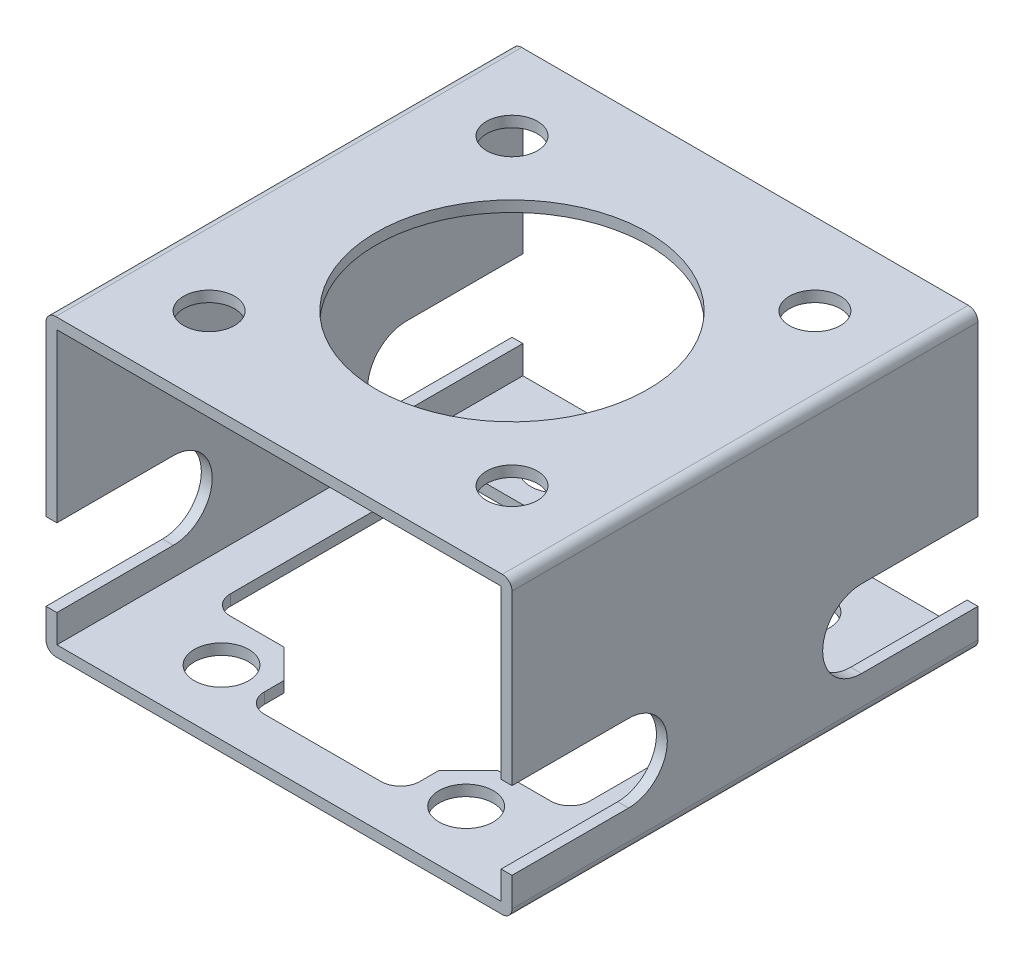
ISO-10303-21;
HEADER;
FILE_DESCRIPTION(('STEP AP214'),'2;1');
FILE_NAME('part.step','',(''),(''),'','','');
FILE_SCHEMA(('AUTOMOTIVE_DESIGN { 1 0 10303 214 1 1 1 1 }'));
ENDSEC;
DATA;
#1=APPLICATION_CONTEXT('core data for automotive mechanical design processes');
#2=APPLICATION_PROTOCOL_DEFINITION('international standard','automotive_design',2000,#1);
#3=PRODUCT_CONTEXT('',#1,'mechanical');
#4=PRODUCT('Part','Part','',(#3));
#5=PRODUCT_RELATED_PRODUCT_CATEGORY('part','',(#4));
#6=PRODUCT_DEFINITION_FORMATION('','',#4);
#7=PRODUCT_DEFINITION_CONTEXT('part definition',#1,'design');
#8=PRODUCT_DEFINITION('design','',#6,#7);
#9=PRODUCT_DEFINITION_SHAPE('','',#8);
#10=(LENGTH_UNIT() NAMED_UNIT(*) SI_UNIT(.MILLI.,.METRE.));
#11=(NAMED_UNIT(*) PLANE_ANGLE_UNIT() SI_UNIT($,.RADIAN.));
#12=(NAMED_UNIT(*) SI_UNIT($,.STERADIAN.) SOLID_ANGLE_UNIT());
#13=UNCERTAINTY_MEASURE_WITH_UNIT(LENGTH_MEASURE(1.E-05),#10,'distance_accuracy_value','');
#14=(GEOMETRIC_REPRESENTATION_CONTEXT(3) GLOBAL_UNCERTAINTY_ASSIGNED_CONTEXT((#13)) GLOBAL_UNIT_ASSIGNED_CONTEXT((#10,
#11,#12)) REPRESENTATION_CONTEXT('',''));
#15=CARTESIAN_POINT('',(0.,0.,0.));
#16=DIRECTION('',(0.,0.,1.));
#17=DIRECTION('',(1.,0.,0.));
#18=AXIS2_PLACEMENT_3D('',#15,#16,#17);
#19=CARTESIAN_POINT('',(1.5875,46.5963,-38.1));
#20=DIRECTION('',(0.,0.,1.));
#21=DIRECTION('',(1.,0.,0.));
#22=AXIS2_PLACEMENT_3D('',#19,#20,#21);
#23=PLANE('',#22);
#24=DIRECTION('',(0.,-1.,0.));
#25=VECTOR('',#24,1.);
#26=CARTESIAN_POINT('',(0.,1.58750000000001,-38.1));
#27=LINE('',#26,#25);
#28=CARTESIAN_POINT('',(0.,6.34999999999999,-38.1));
#29=VERTEX_POINT('',#28);
#30=CARTESIAN_POINT('',(0.,1.58750000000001,-38.1));
#31=VERTEX_POINT('',#30);
#32=EDGE_CURVE('E650',#29,#31,#27,.T.);
#33=ORIENTED_EDGE('',*,*,#32,.F.);
#34=DIRECTION('',(1.,0.,0.));
#35=VECTOR('',#34,1.);
#36=CARTESIAN_POINT('',(1.5875,6.34999999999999,-38.1));
#37=LINE('',#36,#35);
#38=CARTESIAN_POINT('',(1.77800000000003,6.34999999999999,-38.1));
#39=VERTEX_POINT('',#38);
#40=EDGE_CURVE('E726',#29,#39,#37,.T.);
#41=ORIENTED_EDGE('',*,*,#40,.T.);
#42=DIRECTION('',(0.,-1.,0.));
#43=VECTOR('',#42,1.);
#44=CARTESIAN_POINT('',(1.778,1.778,-38.1));
#45=LINE('',#44,#43);
#46=CARTESIAN_POINT('',(1.778,1.778,-38.1));
#47=VERTEX_POINT('',#46);
#48=EDGE_CURVE('E613',#39,#47,#45,.T.);
#49=ORIENTED_EDGE('',*,*,#48,.T.);
#50=DIRECTION('',(1.,0.,0.));
#51=VECTOR('',#50,1.);
#52=CARTESIAN_POINT('',(1.778,1.778,-38.1));
#53=LINE('',#52,#51);
#54=CARTESIAN_POINT('',(74.422,1.778,-38.1));
#55=VERTEX_POINT('',#54);
#56=EDGE_CURVE('E612',#47,#55,#53,.T.);
#57=ORIENTED_EDGE('',*,*,#56,.T.);
#58=DIRECTION('',(0.,1.,0.));
#59=VECTOR('',#58,1.);
#60=CARTESIAN_POINT('',(74.422,1.778,-38.1));
#61=LINE('',#60,#59);
#62=CARTESIAN_POINT('',(74.422,6.34999999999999,-38.1));
#63=VERTEX_POINT('',#62);
#64=EDGE_CURVE('E617',#55,#63,#61,.T.);
#65=ORIENTED_EDGE('',*,*,#64,.T.);
#66=DIRECTION('',(-1.,0.,0.));
#67=VECTOR('',#66,1.);
#68=CARTESIAN_POINT('',(76.2,6.34999999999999,-38.1));
#69=LINE('',#68,#67);
#70=CARTESIAN_POINT('',(76.2,6.34999999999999,-38.1));
#71=VERTEX_POINT('',#70);
#72=EDGE_CURVE('E552',#71,#63,#69,.T.);
#73=ORIENTED_EDGE('',*,*,#72,.F.);
#74=DIRECTION('',(0.,1.,0.));
#75=VECTOR('',#74,1.);
#76=CARTESIAN_POINT('',(76.2,1.58750000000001,-38.1));
#77=LINE('',#76,#75);
#78=CARTESIAN_POINT('',(76.2,1.58750000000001,-38.1));
#79=VERTEX_POINT('',#78);
#80=EDGE_CURVE('E665',#79,#71,#77,.T.);
#81=ORIENTED_EDGE('',*,*,#80,.F.);
#82=CARTESIAN_POINT('',(74.6125,1.5875,-38.1));
#83=DIRECTION('',(0.,0.,1.));
#84=DIRECTION('',(1.,0.,0.));
#85=AXIS2_PLACEMENT_3D('',#82,#83,#84);
#86=CIRCLE('',#85,1.5875);
#87=CARTESIAN_POINT('',(74.6125,0.,-38.1));
#88=VERTEX_POINT('',#87);
#89=EDGE_CURVE('E661',#88,#79,#86,.T.);
#90=ORIENTED_EDGE('',*,*,#89,.F.);
#91=DIRECTION('',(1.,0.,0.));
#92=VECTOR('',#91,1.);
#93=CARTESIAN_POINT('',(1.58750000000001,0.,-38.1));
#94=LINE('',#93,#92);
#95=CARTESIAN_POINT('',(1.58750000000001,0.,-38.1));
#96=VERTEX_POINT('',#95);
#97=EDGE_CURVE('E658',#96,#88,#94,.T.);
#98=ORIENTED_EDGE('',*,*,#97,.F.);
#99=CARTESIAN_POINT('',(1.5875,1.5875,-38.1));
#100=DIRECTION('',(0.,0.,1.));
#101=DIRECTION('',(-1.,0.,0.));
#102=AXIS2_PLACEMENT_3D('',#99,#100,#101);
#103=CIRCLE('',#102,1.5875);
#104=EDGE_CURVE('E655',#31,#96,#103,.T.);
#105=ORIENTED_EDGE('',*,*,#104,.F.);
#106=EDGE_LOOP('',(#33,#41,#49,#57,#65,#73,#81,#90,#98,#105));
#107=FACE_BOUND('',#106,.T.);
#108=ADVANCED_FACE('F30',(#107),#23,.F.);
#109=CARTESIAN_POINT('',(76.2,1.58750000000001,-38.1));
#110=DIRECTION('',(1.,0.,0.));
#111=DIRECTION('',(0.,0.,-1.));
#112=AXIS2_PLACEMENT_3D('',#109,#110,#111);
#113=PLANE('',#112);
#114=DIRECTION('',(0.,0.,1.));
#115=VECTOR('',#114,1.);
#116=CARTESIAN_POINT('',(76.2,6.35,-19.05));
#117=LINE('',#116,#115);
#118=CARTESIAN_POINT('',(76.2,6.35,-19.05));
#119=VERTEX_POINT('',#118);
#120=EDGE_CURVE('E532',#71,#119,#117,.T.);
#121=ORIENTED_EDGE('',*,*,#120,.T.);
#122=CARTESIAN_POINT('',(76.2,12.7,-19.05));
#123=DIRECTION('',(-1.,0.,0.));
#124=DIRECTION('',(0.,0.,1.));
#125=AXIS2_PLACEMENT_3D('',#122,#123,#124);
#126=CIRCLE('',#125,6.35);
#127=CARTESIAN_POINT('',(76.2,19.05,-19.05));
#128=VERTEX_POINT('',#127);
#129=EDGE_CURVE('E529',#119,#128,#126,.T.);
#130=ORIENTED_EDGE('',*,*,#129,.T.);
#131=DIRECTION('',(0.,0.,-1.));
#132=VECTOR('',#131,1.);
#133=CARTESIAN_POINT('',(76.2,19.05,-38.1));
#134=LINE('',#133,#132);
#135=CARTESIAN_POINT('',(76.2,19.05,-38.1));
#136=VERTEX_POINT('',#135);
#137=EDGE_CURVE('E536',#128,#136,#134,.T.);
#138=ORIENTED_EDGE('',*,*,#137,.T.);
#139=CARTESIAN_POINT('',(76.2,46.5963,-38.1));
#140=VERTEX_POINT('',#139);
#141=EDGE_CURVE('E664',#136,#140,#77,.T.);
#142=ORIENTED_EDGE('',*,*,#141,.T.);
#143=DIRECTION('',(0.,0.,1.));
#144=VECTOR('',#143,1.);
#145=CARTESIAN_POINT('',(76.2,46.5963,-38.1));
#146=LINE('',#145,#144);
#147=CARTESIAN_POINT('',(76.2,46.5963,38.1));
#148=VERTEX_POINT('',#147);
#149=EDGE_CURVE('E704',#140,#148,#146,.T.);
#150=ORIENTED_EDGE('',*,*,#149,.T.);
#151=DIRECTION('',(0.,1.,0.));
#152=VECTOR('',#151,1.);
#153=CARTESIAN_POINT('',(76.2,1.58750000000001,38.1));
#154=LINE('',#153,#152);
#155=CARTESIAN_POINT('',(76.2,19.05,38.1));
#156=VERTEX_POINT('',#155);
#157=EDGE_CURVE('E690',#156,#148,#154,.T.);
#158=ORIENTED_EDGE('',*,*,#157,.F.);
#159=DIRECTION('',(0.,0.,1.));
#160=VECTOR('',#159,1.);
#161=CARTESIAN_POINT('',(76.2,19.05,38.1));
#162=LINE('',#161,#160);
#163=CARTESIAN_POINT('',(76.2,19.05,19.05));
#164=VERTEX_POINT('',#163);
#165=EDGE_CURVE('E576',#164,#156,#162,.T.);
#166=ORIENTED_EDGE('',*,*,#165,.F.);
#167=CARTESIAN_POINT('',(76.2,12.7,19.05));
#168=DIRECTION('',(1.,0.,0.));
#169=DIRECTION('',(0.,0.,-1.));
#170=AXIS2_PLACEMENT_3D('',#167,#168,#169);
#171=CIRCLE('',#170,6.35);
#172=CARTESIAN_POINT('',(76.2,6.35,19.05));
#173=VERTEX_POINT('',#172);
#174=EDGE_CURVE('E574',#173,#164,#171,.T.);
#175=ORIENTED_EDGE('',*,*,#174,.F.);
#176=DIRECTION('',(0.,0.,-1.));
#177=VECTOR('',#176,1.);
#178=CARTESIAN_POINT('',(76.2,6.35,19.05));
#179=LINE('',#178,#177);
#180=CARTESIAN_POINT('',(76.2,6.34999999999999,38.1));
#181=VERTEX_POINT('',#180);
#182=EDGE_CURVE('E579',#181,#173,#179,.T.);
#183=ORIENTED_EDGE('',*,*,#182,.F.);
#184=CARTESIAN_POINT('',(76.2,1.58750000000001,38.1));
#185=VERTEX_POINT('',#184);
#186=EDGE_CURVE('E691',#185,#181,#154,.T.);
#187=ORIENTED_EDGE('',*,*,#186,.F.);
#188=DIRECTION('',(0.,0.,1.));
#189=VECTOR('',#188,1.);
#190=CARTESIAN_POINT('',(76.2,1.58750000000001,-38.1));
#191=LINE('',#190,#189);
#192=EDGE_CURVE('E707',#79,#185,#191,.T.);
#193=ORIENTED_EDGE('',*,*,#192,.F.);
#194=ORIENTED_EDGE('',*,*,#80,.T.);
#195=EDGE_LOOP('',(#121,#130,#138,#142,#150,#158,#166,#175,#183,#187,#193,#194));
#196=FACE_BOUND('',#195,.T.);
#197=ADVANCED_FACE('F814',(#196),#113,.T.);
#198=CARTESIAN_POINT('',(0.,1.58750000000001,-38.1));
#199=DIRECTION('',(-1.,0.,0.));
#200=DIRECTION('',(0.,0.,1.));
#201=AXIS2_PLACEMENT_3D('',#198,#199,#200);
#202=PLANE('',#201);
#203=DIRECTION('',(0.,0.,1.));
#204=VECTOR('',#203,1.);
#205=CARTESIAN_POINT('',(0.,6.35,-19.05));
#206=LINE('',#205,#204);
#207=CARTESIAN_POINT('',(0.,6.35,-19.05));
#208=VERTEX_POINT('',#207);
#209=EDGE_CURVE('E542',#29,#208,#206,.T.);
#210=ORIENTED_EDGE('',*,*,#209,.F.);
#211=ORIENTED_EDGE('',*,*,#32,.T.);
#212=DIRECTION('',(0.,0.,1.));
#213=VECTOR('',#212,1.);
#214=CARTESIAN_POINT('',(0.,1.58750000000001,-38.1));
#215=LINE('',#214,#213);
#216=CARTESIAN_POINT('',(0.,1.58750000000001,38.1));
#217=VERTEX_POINT('',#216);
#218=EDGE_CURVE('E713',#31,#217,#215,.T.);
#219=ORIENTED_EDGE('',*,*,#218,.T.);
#220=DIRECTION('',(0.,-1.,0.));
#221=VECTOR('',#220,1.);
#222=CARTESIAN_POINT('',(0.,1.58750000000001,38.1));
#223=LINE('',#222,#221);
#224=CARTESIAN_POINT('',(0.,6.34999999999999,38.1));
#225=VERTEX_POINT('',#224);
#226=EDGE_CURVE('E677',#225,#217,#223,.T.);
#227=ORIENTED_EDGE('',*,*,#226,.F.);
#228=DIRECTION('',(0.,0.,-1.));
#229=VECTOR('',#228,1.);
#230=CARTESIAN_POINT('',(0.,6.35,19.05));
#231=LINE('',#230,#229);
#232=CARTESIAN_POINT('',(0.,6.35,19.05));
#233=VERTEX_POINT('',#232);
#234=EDGE_CURVE('E577',#225,#233,#231,.T.);
#235=ORIENTED_EDGE('',*,*,#234,.T.);
#236=CARTESIAN_POINT('',(0.,12.7,19.05));
#237=DIRECTION('',(1.,0.,0.));
#238=DIRECTION('',(0.,0.,-1.));
#239=AXIS2_PLACEMENT_3D('',#236,#237,#238);
#240=CIRCLE('',#239,6.35);
#241=CARTESIAN_POINT('',(0.,19.05,19.05));
#242=VERTEX_POINT('',#241);
#243=EDGE_CURVE('E573',#233,#242,#240,.T.);
#244=ORIENTED_EDGE('',*,*,#243,.T.);
#245=DIRECTION('',(0.,0.,1.));
#246=VECTOR('',#245,1.);
#247=CARTESIAN_POINT('',(0.,19.05,38.1));
#248=LINE('',#247,#246);
#249=CARTESIAN_POINT('',(0.,19.05,38.1));
#250=VERTEX_POINT('',#249);
#251=EDGE_CURVE('E584',#242,#250,#248,.T.);
#252=ORIENTED_EDGE('',*,*,#251,.T.);
#253=CARTESIAN_POINT('',(0.,46.5963,38.1));
#254=VERTEX_POINT('',#253);
#255=EDGE_CURVE('E678',#254,#250,#223,.T.);
#256=ORIENTED_EDGE('',*,*,#255,.F.);
#257=DIRECTION('',(0.,0.,1.));
#258=VECTOR('',#257,1.);
#259=CARTESIAN_POINT('',(0.,46.5963,-38.1));
#260=LINE('',#259,#258);
#261=CARTESIAN_POINT('',(0.,46.5963,-38.1));
#262=VERTEX_POINT('',#261);
#263=EDGE_CURVE('E674',#262,#254,#260,.T.);
#264=ORIENTED_EDGE('',*,*,#263,.F.);
#265=CARTESIAN_POINT('',(0.,19.05,-38.1));
#266=VERTEX_POINT('',#265);
#267=EDGE_CURVE('E652',#262,#266,#27,.T.);
#268=ORIENTED_EDGE('',*,*,#267,.T.);
#269=DIRECTION('',(0.,0.,-1.));
#270=VECTOR('',#269,1.);
#271=CARTESIAN_POINT('',(0.,19.05,-38.1));
#272=LINE('',#271,#270);
#273=CARTESIAN_POINT('',(0.,19.05,-19.05));
#274=VERTEX_POINT('',#273);
#275=EDGE_CURVE('E533',#274,#266,#272,.T.);
#276=ORIENTED_EDGE('',*,*,#275,.F.);
#277=CARTESIAN_POINT('',(0.,12.7,-19.05));
#278=DIRECTION('',(-1.,0.,0.));
#279=DIRECTION('',(0.,0.,1.));
#280=AXIS2_PLACEMENT_3D('',#277,#278,#279);
#281=CIRCLE('',#280,6.35);
#282=EDGE_CURVE('E526',#208,#274,#281,.T.);
#283=ORIENTED_EDGE('',*,*,#282,.F.);
#284=EDGE_LOOP('',(#210,#211,#219,#227,#235,#244,#252,#256,#264,#268,#276,#283));
#285=FACE_BOUND('',#284,.T.);
#286=ADVANCED_FACE('F821',(#285),#202,.T.);
#287=CARTESIAN_POINT('',(1.5875,46.5963,38.1));
#288=DIRECTION('',(0.,0.,1.));
#289=DIRECTION('',(1.,0.,0.));
#290=AXIS2_PLACEMENT_3D('',#287,#288,#289);
#291=PLANE('',#290);
#292=ORIENTED_EDGE('',*,*,#255,.T.);
#293=DIRECTION('',(-1.,0.,0.));
#294=VECTOR('',#293,1.);
#295=CARTESIAN_POINT('',(76.2,19.05,38.1));
#296=LINE('',#295,#294);
#297=CARTESIAN_POINT('',(1.77800000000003,19.05,38.1));
#298=VERTEX_POINT('',#297);
#299=EDGE_CURVE('E595',#298,#250,#296,.T.);
#300=ORIENTED_EDGE('',*,*,#299,.F.);
#301=DIRECTION('',(0.,-1.,0.));
#302=VECTOR('',#301,1.);
#303=CARTESIAN_POINT('',(1.778,1.778,38.1));
#304=LINE('',#303,#302);
#305=CARTESIAN_POINT('',(1.778,46.4058,38.1));
#306=VERTEX_POINT('',#305);
#307=EDGE_CURVE('E624',#306,#298,#304,.T.);
#308=ORIENTED_EDGE('',*,*,#307,.F.);
#309=DIRECTION('',(-1.,0.,0.));
#310=VECTOR('',#309,1.);
#311=CARTESIAN_POINT('',(1.778,46.4058,38.1));
#312=LINE('',#311,#310);
#313=CARTESIAN_POINT('',(74.422,46.4058,38.1));
#314=VERTEX_POINT('',#313);
#315=EDGE_CURVE('E634',#314,#306,#312,.T.);
#316=ORIENTED_EDGE('',*,*,#315,.F.);
#317=DIRECTION('',(0.,1.,0.));
#318=VECTOR('',#317,1.);
#319=CARTESIAN_POINT('',(74.422,1.778,38.1));
#320=LINE('',#319,#318);
#321=CARTESIAN_POINT('',(74.422,19.05,38.1));
#322=VERTEX_POINT('',#321);
#323=EDGE_CURVE('E630',#322,#314,#320,.T.);
#324=ORIENTED_EDGE('',*,*,#323,.F.);
#325=EDGE_CURVE('E596',#156,#322,#296,.T.);
#326=ORIENTED_EDGE('',*,*,#325,.F.);
#327=ORIENTED_EDGE('',*,*,#157,.T.);
#328=CARTESIAN_POINT('',(74.6125,46.5963,38.1));
#329=DIRECTION('',(0.,0.,1.));
#330=DIRECTION('',(1.,0.,0.));
#331=AXIS2_PLACEMENT_3D('',#328,#329,#330);
#332=CIRCLE('',#331,1.5875);
#333=CARTESIAN_POINT('',(74.6125,48.1838,38.1));
#334=VERTEX_POINT('',#333);
#335=EDGE_CURVE('E694',#148,#334,#332,.T.);
#336=ORIENTED_EDGE('',*,*,#335,.T.);
#337=DIRECTION('',(-1.,0.,0.));
#338=VECTOR('',#337,1.);
#339=CARTESIAN_POINT('',(1.5875,48.1838,38.1));
#340=LINE('',#339,#338);
#341=CARTESIAN_POINT('',(1.5875,48.1838,38.1));
#342=VERTEX_POINT('',#341);
#343=EDGE_CURVE('E651',#334,#342,#340,.T.);
#344=ORIENTED_EDGE('',*,*,#343,.T.);
#345=CARTESIAN_POINT('',(1.5875,46.5963,38.1));
#346=DIRECTION('',(0.,0.,1.));
#347=DIRECTION('',(1.,0.,0.));
#348=AXIS2_PLACEMENT_3D('',#345,#346,#347);
#349=CIRCLE('',#348,1.5875);
#350=EDGE_CURVE('E639',#342,#254,#349,.T.);
#351=ORIENTED_EDGE('',*,*,#350,.T.);
#352=EDGE_LOOP('',(#292,#300,#308,#316,#324,#326,#327,#336,#344,#351));
#353=FACE_BOUND('',#352,.T.);
#354=ADVANCED_FACE('F851',(#353),#291,.T.);
#355=ORIENTED_EDGE('',*,*,#186,.T.);
#356=DIRECTION('',(-1.,0.,0.));
#357=VECTOR('',#356,1.);
#358=CARTESIAN_POINT('',(76.2,6.34999999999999,38.1));
#359=LINE('',#358,#357);
#360=CARTESIAN_POINT('',(74.422,6.34999999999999,38.1));
#361=VERTEX_POINT('',#360);
#362=EDGE_CURVE('E592',#181,#361,#359,.T.);
#363=ORIENTED_EDGE('',*,*,#362,.T.);
#364=CARTESIAN_POINT('',(74.422,1.778,38.1));
#365=VERTEX_POINT('',#364);
#366=EDGE_CURVE('E631',#365,#361,#320,.T.);
#367=ORIENTED_EDGE('',*,*,#366,.F.);
#368=DIRECTION('',(1.,0.,0.));
#369=VECTOR('',#368,1.);
#370=CARTESIAN_POINT('',(1.778,1.778,38.1));
#371=LINE('',#370,#369);
#372=CARTESIAN_POINT('',(1.778,1.778,38.1));
#373=VERTEX_POINT('',#372);
#374=EDGE_CURVE('E627',#373,#365,#371,.T.);
#375=ORIENTED_EDGE('',*,*,#374,.F.);
#376=CARTESIAN_POINT('',(1.778,6.35,38.1));
#377=VERTEX_POINT('',#376);
#378=EDGE_CURVE('E608',#377,#373,#304,.T.);
#379=ORIENTED_EDGE('',*,*,#378,.F.);
#380=EDGE_CURVE('E591',#377,#225,#359,.T.);
#381=ORIENTED_EDGE('',*,*,#380,.T.);
#382=ORIENTED_EDGE('',*,*,#226,.T.);
#383=CARTESIAN_POINT('',(1.5875,1.5875,38.1));
#384=DIRECTION('',(0.,0.,1.));
#385=DIRECTION('',(-1.,0.,0.));
#386=AXIS2_PLACEMENT_3D('',#383,#384,#385);
#387=CIRCLE('',#386,1.5875);
#388=CARTESIAN_POINT('',(1.58750000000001,0.,38.1));
#389=VERTEX_POINT('',#388);
#390=EDGE_CURVE('E681',#217,#389,#387,.T.);
#391=ORIENTED_EDGE('',*,*,#390,.T.);
#392=DIRECTION('',(1.,0.,0.));
#393=VECTOR('',#392,1.);
#394=CARTESIAN_POINT('',(1.58750000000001,0.,38.1));
#395=LINE('',#394,#393);
#396=CARTESIAN_POINT('',(74.6125,0.,38.1));
#397=VERTEX_POINT('',#396);
#398=EDGE_CURVE('E684',#389,#397,#395,.T.);
#399=ORIENTED_EDGE('',*,*,#398,.T.);
#400=CARTESIAN_POINT('',(74.6125,1.5875,38.1));
#401=DIRECTION('',(0.,0.,1.));
#402=DIRECTION('',(1.,0.,0.));
#403=AXIS2_PLACEMENT_3D('',#400,#401,#402);
#404=CIRCLE('',#403,1.5875);
#405=EDGE_CURVE('E687',#397,#185,#404,.T.);
#406=ORIENTED_EDGE('',*,*,#405,.T.);
#407=EDGE_LOOP('',(#355,#363,#367,#375,#379,#381,#382,#391,#399,#406));
#408=FACE_BOUND('',#407,.T.);
#409=ADVANCED_FACE('F899',(#408),#291,.T.);
#410=CARTESIAN_POINT('',(1.778,1.778,-38.1));
#411=DIRECTION('',(-1.,0.,0.));
#412=DIRECTION('',(0.,0.,1.));
#413=AXIS2_PLACEMENT_3D('',#410,#411,#412);
#414=PLANE('',#413);
#415=ORIENTED_EDGE('',*,*,#48,.F.);
#416=DIRECTION('',(0.,0.,1.));
#417=VECTOR('',#416,1.);
#418=CARTESIAN_POINT('',(1.778,6.34999999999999,-38.1));
#419=LINE('',#418,#417);
#420=CARTESIAN_POINT('',(1.77800000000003,6.35,-19.05));
#421=VERTEX_POINT('',#420);
#422=EDGE_CURVE('E567',#39,#421,#419,.T.);
#423=ORIENTED_EDGE('',*,*,#422,.T.);
#424=CARTESIAN_POINT('',(1.77800000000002,12.7,-19.05));
#425=DIRECTION('',(-1.,0.,0.));
#426=DIRECTION('',(0.,0.,1.));
#427=AXIS2_PLACEMENT_3D('',#424,#425,#426);
#428=CIRCLE('',#427,6.35);
#429=CARTESIAN_POINT('',(1.77800000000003,19.05,-19.05));
#430=VERTEX_POINT('',#429);
#431=EDGE_CURVE('E570',#421,#430,#428,.T.);
#432=ORIENTED_EDGE('',*,*,#431,.T.);
#433=DIRECTION('',(0.,0.,-1.));
#434=VECTOR('',#433,1.);
#435=CARTESIAN_POINT('',(1.778,19.05,-38.1));
#436=LINE('',#435,#434);
#437=CARTESIAN_POINT('',(1.77800000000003,19.05,-38.1));
#438=VERTEX_POINT('',#437);
#439=EDGE_CURVE('E561',#430,#438,#436,.T.);
#440=ORIENTED_EDGE('',*,*,#439,.T.);
#441=CARTESIAN_POINT('',(1.778,46.4058,-38.1));
#442=VERTEX_POINT('',#441);
#443=EDGE_CURVE('E609',#442,#438,#45,.T.);
#444=ORIENTED_EDGE('',*,*,#443,.F.);
#445=DIRECTION('',(0.,0.,1.));
#446=VECTOR('',#445,1.);
#447=CARTESIAN_POINT('',(1.778,46.4058,-38.1));
#448=LINE('',#447,#446);
#449=EDGE_CURVE('E637',#442,#306,#448,.T.);
#450=ORIENTED_EDGE('',*,*,#449,.T.);
#451=ORIENTED_EDGE('',*,*,#307,.T.);
#452=DIRECTION('',(0.,0.,1.));
#453=VECTOR('',#452,1.);
#454=CARTESIAN_POINT('',(1.778,19.05,-38.1));
#455=LINE('',#454,#453);
#456=CARTESIAN_POINT('',(1.77800000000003,19.05,19.05));
#457=VERTEX_POINT('',#456);
#458=EDGE_CURVE('E604',#457,#298,#455,.T.);
#459=ORIENTED_EDGE('',*,*,#458,.F.);
#460=CARTESIAN_POINT('',(1.77800000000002,12.7,19.05));
#461=DIRECTION('',(-1.,0.,0.));
#462=DIRECTION('',(0.,0.,1.));
#463=AXIS2_PLACEMENT_3D('',#460,#461,#462);
#464=CIRCLE('',#463,6.35);
#465=CARTESIAN_POINT('',(1.77800000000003,6.35,19.05));
#466=VERTEX_POINT('',#465);
#467=EDGE_CURVE('E606',#466,#457,#464,.F.);
#468=ORIENTED_EDGE('',*,*,#467,.F.);
#469=DIRECTION('',(0.,0.,-1.));
#470=VECTOR('',#469,1.);
#471=CARTESIAN_POINT('',(1.778,6.35,-38.1));
#472=LINE('',#471,#470);
#473=EDGE_CURVE('E602',#377,#466,#472,.T.);
#474=ORIENTED_EDGE('',*,*,#473,.F.);
#475=ORIENTED_EDGE('',*,*,#378,.T.);
#476=DIRECTION('',(0.,0.,1.));
#477=VECTOR('',#476,1.);
#478=CARTESIAN_POINT('',(1.778,1.778,-38.1));
#479=LINE('',#478,#477);
#480=EDGE_CURVE('E623',#47,#373,#479,.T.);
#481=ORIENTED_EDGE('',*,*,#480,.F.);
#482=EDGE_LOOP('',(#415,#423,#432,#440,#444,#450,#451,#459,#468,#474,#475,#481));
#483=FACE_BOUND('',#482,.T.);
#484=ADVANCED_FACE('F874',(#483),#414,.F.);
#485=CARTESIAN_POINT('',(74.422,1.778,-38.1));
#486=DIRECTION('',(1.,0.,0.));
#487=DIRECTION('',(0.,0.,-1.));
#488=AXIS2_PLACEMENT_3D('',#485,#486,#487);
#489=PLANE('',#488);
#490=CARTESIAN_POINT('',(74.422,12.7,-19.05));
#491=DIRECTION('',(1.,0.,0.));
#492=DIRECTION('',(0.,0.,-1.));
#493=AXIS2_PLACEMENT_3D('',#490,#491,#492);
#494=CIRCLE('',#493,6.35);
#495=CARTESIAN_POINT('',(74.422,19.05,-19.05));
#496=VERTEX_POINT('',#495);
#497=CARTESIAN_POINT('',(74.422,6.35,-19.05));
#498=VERTEX_POINT('',#497);
#499=EDGE_CURVE('E729',#496,#498,#494,.T.);
#500=ORIENTED_EDGE('',*,*,#499,.T.);
#501=DIRECTION('',(0.,0.,-1.));
#502=VECTOR('',#501,1.);
#503=CARTESIAN_POINT('',(74.422,6.34999999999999,-38.1));
#504=LINE('',#503,#502);
#505=EDGE_CURVE('E564',#498,#63,#504,.T.);
#506=ORIENTED_EDGE('',*,*,#505,.T.);
#507=ORIENTED_EDGE('',*,*,#64,.F.);
#508=DIRECTION('',(0.,0.,1.));
#509=VECTOR('',#508,1.);
#510=CARTESIAN_POINT('',(74.422,1.778,-38.1));
#511=LINE('',#510,#509);
#512=EDGE_CURVE('E643',#55,#365,#511,.T.);
#513=ORIENTED_EDGE('',*,*,#512,.T.);
#514=ORIENTED_EDGE('',*,*,#366,.T.);
#515=DIRECTION('',(0.,0.,1.));
#516=VECTOR('',#515,1.);
#517=CARTESIAN_POINT('',(74.422,6.35,-38.1));
#518=LINE('',#517,#516);
#519=CARTESIAN_POINT('',(74.422,6.35,19.05));
#520=VERTEX_POINT('',#519);
#521=EDGE_CURVE('E701',#520,#361,#518,.T.);
#522=ORIENTED_EDGE('',*,*,#521,.F.);
#523=CARTESIAN_POINT('',(74.422,12.7,19.05));
#524=DIRECTION('',(1.,0.,0.));
#525=DIRECTION('',(0.,0.,-1.));
#526=AXIS2_PLACEMENT_3D('',#523,#524,#525);
#527=CIRCLE('',#526,6.35);
#528=CARTESIAN_POINT('',(74.422,19.05,19.05));
#529=VERTEX_POINT('',#528);
#530=EDGE_CURVE('E718',#529,#520,#527,.F.);
#531=ORIENTED_EDGE('',*,*,#530,.F.);
#532=DIRECTION('',(0.,0.,-1.));
#533=VECTOR('',#532,1.);
#534=CARTESIAN_POINT('',(74.422,19.05,-38.1));
#535=LINE('',#534,#533);
#536=EDGE_CURVE('E721',#322,#529,#535,.T.);
#537=ORIENTED_EDGE('',*,*,#536,.F.);
#538=ORIENTED_EDGE('',*,*,#323,.T.);
#539=DIRECTION('',(0.,0.,1.));
#540=VECTOR('',#539,1.);
#541=CARTESIAN_POINT('',(74.422,46.4058,-38.1));
#542=LINE('',#541,#540);
#543=CARTESIAN_POINT('',(74.422,46.4058,-38.1));
#544=VERTEX_POINT('',#543);
#545=EDGE_CURVE('E640',#544,#314,#542,.T.);
#546=ORIENTED_EDGE('',*,*,#545,.F.);
#547=CARTESIAN_POINT('',(74.422,19.05,-38.1));
#548=VERTEX_POINT('',#547);
#549=EDGE_CURVE('E616',#548,#544,#61,.T.);
#550=ORIENTED_EDGE('',*,*,#549,.F.);
#551=DIRECTION('',(0.,0.,1.));
#552=VECTOR('',#551,1.);
#553=CARTESIAN_POINT('',(74.422,19.05,-38.1));
#554=LINE('',#553,#552);
#555=EDGE_CURVE('E558',#548,#496,#554,.T.);
#556=ORIENTED_EDGE('',*,*,#555,.T.);
#557=EDGE_LOOP('',(#500,#506,#507,#513,#514,#522,#531,#537,#538,#546,#550,#556));
#558=FACE_BOUND('',#557,.T.);
#559=ADVANCED_FACE('F883',(#558),#489,.F.);
#560=CARTESIAN_POINT('',(1.5875,46.5963,-38.1));
#561=DIRECTION('',(0.,0.,1.));
#562=DIRECTION('',(1.,0.,0.));
#563=AXIS2_PLACEMENT_3D('',#560,#561,#562);
#564=CYLINDRICAL_SURFACE('',#563,1.5875);
#565=ORIENTED_EDGE('',*,*,#350,.F.);
#566=DIRECTION('',(0.,0.,1.));
#567=VECTOR('',#566,1.);
#568=CARTESIAN_POINT('',(1.5875,48.1838,-38.1));
#569=LINE('',#568,#567);
#570=CARTESIAN_POINT('',(1.5875,48.1838,-38.1));
#571=VERTEX_POINT('',#570);
#572=EDGE_CURVE('E699',#571,#342,#569,.T.);
#573=ORIENTED_EDGE('',*,*,#572,.F.);
#574=CARTESIAN_POINT('',(1.5875,46.5963,-38.1));
#575=DIRECTION('',(0.,0.,1.));
#576=DIRECTION('',(1.,0.,0.));
#577=AXIS2_PLACEMENT_3D('',#574,#575,#576);
#578=CIRCLE('',#577,1.5875);
#579=EDGE_CURVE('E647',#571,#262,#578,.T.);
#580=ORIENTED_EDGE('',*,*,#579,.T.);
#581=ORIENTED_EDGE('',*,*,#263,.T.);
#582=EDGE_LOOP('',(#565,#573,#580,#581));
#583=FACE_BOUND('',#582,.T.);
#584=ADVANCED_FACE('F858',(#583),#564,.T.);
#585=CARTESIAN_POINT('',(1.5875,48.1838,-38.1));
#586=DIRECTION('',(0.,1.,0.));
#587=DIRECTION('',(0.,0.,1.));
#588=AXIS2_PLACEMENT_3D('',#585,#586,#587);
#589=PLANE('',#588);
#590=CARTESIAN_POINT('',(13.335,48.1838,24.765));
#591=DIRECTION('',(0.,1.,0.));
#592=DIRECTION('',(0.,0.,1.));
#593=AXIS2_PLACEMENT_3D('',#590,#591,#592);
#594=CIRCLE('',#593,4.1656);
#595=CARTESIAN_POINT('',(13.335,48.1838,28.9306));
#596=VERTEX_POINT('',#595);
#597=EDGE_CURVE('E496',#596,#596,#594,.T.);
#598=ORIENTED_EDGE('',*,*,#597,.F.);
#599=EDGE_LOOP('',(#598));
#600=FACE_BOUND('',#599,.T.);
#601=CARTESIAN_POINT('',(62.865,48.1838,24.765));
#602=DIRECTION('',(0.,1.,0.));
#603=DIRECTION('',(0.,0.,1.));
#604=AXIS2_PLACEMENT_3D('',#601,#602,#603);
#605=CIRCLE('',#604,4.1656);
#606=CARTESIAN_POINT('',(62.865,48.1838,28.9306));
#607=VERTEX_POINT('',#606);
#608=EDGE_CURVE('E502',#607,#607,#605,.T.);
#609=ORIENTED_EDGE('',*,*,#608,.F.);
#610=EDGE_LOOP('',(#609));
#611=FACE_BOUND('',#610,.T.);
#612=CARTESIAN_POINT('',(62.865,48.1838,-24.765));
#613=DIRECTION('',(0.,1.,0.));
#614=DIRECTION('',(0.,0.,1.));
#615=AXIS2_PLACEMENT_3D('',#612,#613,#614);
#616=CIRCLE('',#615,4.1656);
#617=CARTESIAN_POINT('',(62.865,48.1838,-20.5994));
#618=VERTEX_POINT('',#617);
#619=EDGE_CURVE('E508',#618,#618,#616,.T.);
#620=ORIENTED_EDGE('',*,*,#619,.F.);
#621=EDGE_LOOP('',(#620));
#622=FACE_BOUND('',#621,.T.);
#623=CARTESIAN_POINT('',(13.335,48.1838,-24.765));
#624=DIRECTION('',(0.,1.,0.));
#625=DIRECTION('',(0.,0.,1.));
#626=AXIS2_PLACEMENT_3D('',#623,#624,#625);
#627=CIRCLE('',#626,4.1656);
#628=CARTESIAN_POINT('',(13.335,48.1838,-20.5994));
#629=VERTEX_POINT('',#628);
#630=EDGE_CURVE('E514',#629,#629,#627,.T.);
#631=ORIENTED_EDGE('',*,*,#630,.F.);
#632=EDGE_LOOP('',(#631));
#633=FACE_BOUND('',#632,.T.);
#634=CARTESIAN_POINT('',(38.1,48.1838,0.));
#635=DIRECTION('',(0.,1.,0.));
#636=DIRECTION('',(0.,0.,1.));
#637=AXIS2_PLACEMENT_3D('',#634,#635,#636);
#638=CIRCLE('',#637,22.225);
#639=CARTESIAN_POINT('',(38.1,48.1838,22.225));
#640=VERTEX_POINT('',#639);
#641=EDGE_CURVE('E520',#640,#640,#638,.T.);
#642=ORIENTED_EDGE('',*,*,#641,.F.);
#643=EDGE_LOOP('',(#642));
#644=FACE_BOUND('',#643,.T.);
#645=ORIENTED_EDGE('',*,*,#343,.F.);
#646=DIRECTION('',(0.,0.,1.));
#647=VECTOR('',#646,1.);
#648=CARTESIAN_POINT('',(74.6125,48.1838,-38.1));
#649=LINE('',#648,#647);
#650=CARTESIAN_POINT('',(74.6125,48.1838,-38.1));
#651=VERTEX_POINT('',#650);
#652=EDGE_CURVE('E702',#651,#334,#649,.T.);
#653=ORIENTED_EDGE('',*,*,#652,.F.);
#654=DIRECTION('',(-1.,0.,0.));
#655=VECTOR('',#654,1.);
#656=CARTESIAN_POINT('',(1.5875,48.1838,-38.1));
#657=LINE('',#656,#655);
#658=EDGE_CURVE('E671',#651,#571,#657,.T.);
#659=ORIENTED_EDGE('',*,*,#658,.T.);
#660=ORIENTED_EDGE('',*,*,#572,.T.);
#661=EDGE_LOOP('',(#645,#653,#659,#660));
#662=FACE_BOUND('',#661,.T.);
#663=ADVANCED_FACE('F854',(#600,#611,#622,#633,#644,#662),#589,.T.);
#664=CARTESIAN_POINT('',(74.6125,46.5963,-38.1));
#665=DIRECTION('',(0.,0.,1.));
#666=DIRECTION('',(1.,0.,0.));
#667=AXIS2_PLACEMENT_3D('',#664,#665,#666);
#668=CYLINDRICAL_SURFACE('',#667,1.5875);
#669=ORIENTED_EDGE('',*,*,#335,.F.);
#670=ORIENTED_EDGE('',*,*,#149,.F.);
#671=CARTESIAN_POINT('',(74.6125,46.5963,-38.1));
#672=DIRECTION('',(0.,0.,1.));
#673=DIRECTION('',(1.,0.,0.));
#674=AXIS2_PLACEMENT_3D('',#671,#672,#673);
#675=CIRCLE('',#674,1.5875);
#676=EDGE_CURVE('E668',#140,#651,#675,.T.);
#677=ORIENTED_EDGE('',*,*,#676,.T.);
#678=ORIENTED_EDGE('',*,*,#652,.T.);
#679=EDGE_LOOP('',(#669,#670,#677,#678));
#680=FACE_BOUND('',#679,.T.);
#681=ADVANCED_FACE('F848',(#680),#668,.T.);
#682=CARTESIAN_POINT('',(74.6125,1.5875,-38.1));
#683=DIRECTION('',(0.,0.,1.));
#684=DIRECTION('',(1.,0.,0.));
#685=AXIS2_PLACEMENT_3D('',#682,#683,#684);
#686=CYLINDRICAL_SURFACE('',#685,1.5875);
#687=ORIENTED_EDGE('',*,*,#405,.F.);
#688=DIRECTION('',(0.,0.,1.));
#689=VECTOR('',#688,1.);
#690=CARTESIAN_POINT('',(74.6125,0.,-38.1));
#691=LINE('',#690,#689);
#692=EDGE_CURVE('E709',#88,#397,#691,.T.);
#693=ORIENTED_EDGE('',*,*,#692,.F.);
#694=ORIENTED_EDGE('',*,*,#89,.T.);
#695=ORIENTED_EDGE('',*,*,#192,.T.);
#696=EDGE_LOOP('',(#687,#693,#694,#695));
#697=FACE_BOUND('',#696,.T.);
#698=ADVANCED_FACE('F904',(#697),#686,.T.);
#699=CARTESIAN_POINT('',(1.58750000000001,0.,-38.1));
#700=DIRECTION('',(0.,-1.,0.));
#701=DIRECTION('',(0.,0.,-1.));
#702=AXIS2_PLACEMENT_3D('',#699,#700,#701);
#703=PLANE('',#702);
#704=DIRECTION('',(0.,0.,-1.));
#705=VECTOR('',#704,1.);
#706=CARTESIAN_POINT('',(25.4,0.,30.95625));
#707=LINE('',#706,#705);
#708=CARTESIAN_POINT('',(25.4,0.,27.78125));
#709=VERTEX_POINT('',#708);
#710=CARTESIAN_POINT('',(25.4,0.,24.60625));
#711=VERTEX_POINT('',#710);
#712=EDGE_CURVE('E371',#709,#711,#707,.T.);
#713=ORIENTED_EDGE('',*,*,#712,.F.);
#714=CARTESIAN_POINT('',(28.575,0.,27.78125));
#715=DIRECTION('',(0.,-1.,0.));
#716=DIRECTION('',(0.,0.,-1.));
#717=AXIS2_PLACEMENT_3D('',#714,#715,#716);
#718=CIRCLE('',#717,3.175);
#719=CARTESIAN_POINT('',(28.575,0.,30.95625));
#720=VERTEX_POINT('',#719);
#721=EDGE_CURVE('E38',#709,#720,#718,.F.);
#722=ORIENTED_EDGE('',*,*,#721,.T.);
#723=DIRECTION('',(-1.,0.,0.));
#724=VECTOR('',#723,1.);
#725=CARTESIAN_POINT('',(25.4,0.,30.95625));
#726=LINE('',#725,#724);
#727=CARTESIAN_POINT('',(47.625,0.,30.95625));
#728=VERTEX_POINT('',#727);
#729=EDGE_CURVE('E365',#728,#720,#726,.T.);
#730=ORIENTED_EDGE('',*,*,#729,.F.);
#731=CARTESIAN_POINT('',(47.625,0.,27.78125));
#732=DIRECTION('',(0.,-1.,0.));
#733=DIRECTION('',(0.,0.,-1.));
#734=AXIS2_PLACEMENT_3D('',#731,#732,#733);
#735=CIRCLE('',#734,3.175);
#736=CARTESIAN_POINT('',(50.8,0.,27.78125));
#737=VERTEX_POINT('',#736);
#738=EDGE_CURVE('E783',#728,#737,#735,.F.);
#739=ORIENTED_EDGE('',*,*,#738,.T.);
#740=DIRECTION('',(0.,0.,1.));
#741=VECTOR('',#740,1.);
#742=CARTESIAN_POINT('',(50.8,0.,30.95625));
#743=LINE('',#742,#741);
#744=CARTESIAN_POINT('',(50.8,0.,24.60625));
#745=VERTEX_POINT('',#744);
#746=EDGE_CURVE('E453',#745,#737,#743,.T.);
#747=ORIENTED_EDGE('',*,*,#746,.F.);
#748=DIRECTION('',(-0.707106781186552,0.,0.707106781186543));
#749=VECTOR('',#748,1.);
#750=CARTESIAN_POINT('',(50.8,0.,24.60625));
#751=LINE('',#750,#749);
#752=CARTESIAN_POINT('',(55.5625000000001,0.,19.84375));
#753=VERTEX_POINT('',#752);
#754=EDGE_CURVE('E450',#753,#745,#751,.T.);
#755=ORIENTED_EDGE('',*,*,#754,.F.);
#756=DIRECTION('',(-1.,0.,0.));
#757=VECTOR('',#756,1.);
#758=CARTESIAN_POINT('',(67.46875,0.,19.84375));
#759=LINE('',#758,#757);
#760=CARTESIAN_POINT('',(64.29375,0.,19.84375));
#761=VERTEX_POINT('',#760);
#762=EDGE_CURVE('E448',#761,#753,#759,.T.);
#763=ORIENTED_EDGE('',*,*,#762,.F.);
#764=CARTESIAN_POINT('',(64.29375,0.,16.66875));
#765=DIRECTION('',(0.,-1.,0.));
#766=DIRECTION('',(0.,0.,-1.));
#767=AXIS2_PLACEMENT_3D('',#764,#765,#766);
#768=CIRCLE('',#767,3.175);
#769=CARTESIAN_POINT('',(67.46875,0.,16.66875));
#770=VERTEX_POINT('',#769);
#771=EDGE_CURVE('E779',#761,#770,#768,.F.);
#772=ORIENTED_EDGE('',*,*,#771,.T.);
#773=DIRECTION('',(0.,0.,1.));
#774=VECTOR('',#773,1.);
#775=CARTESIAN_POINT('',(67.46875,0.,19.84375));
#776=LINE('',#775,#774);
#777=CARTESIAN_POINT('',(67.46875,0.,-16.66875));
#778=VERTEX_POINT('',#777);
#779=EDGE_CURVE('E445',#778,#770,#776,.T.);
#780=ORIENTED_EDGE('',*,*,#779,.F.);
#781=CARTESIAN_POINT('',(64.29375,0.,-16.66875));
#782=DIRECTION('',(0.,-1.,0.));
#783=DIRECTION('',(0.,0.,-1.));
#784=AXIS2_PLACEMENT_3D('',#781,#782,#783);
#785=CIRCLE('',#784,3.175);
#786=CARTESIAN_POINT('',(64.29375,0.,-19.84375));
#787=VERTEX_POINT('',#786);
#788=EDGE_CURVE('E771',#778,#787,#785,.F.);
#789=ORIENTED_EDGE('',*,*,#788,.T.);
#790=DIRECTION('',(1.,0.,0.));
#791=VECTOR('',#790,1.);
#792=CARTESIAN_POINT('',(67.46875,0.,-19.84375));
#793=LINE('',#792,#791);
#794=CARTESIAN_POINT('',(55.5625,0.,-19.84375));
#795=VERTEX_POINT('',#794);
#796=EDGE_CURVE('E442',#795,#787,#793,.T.);
#797=ORIENTED_EDGE('',*,*,#796,.F.);
#798=DIRECTION('',(0.707106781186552,0.,0.707106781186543));
#799=VECTOR('',#798,1.);
#800=CARTESIAN_POINT('',(50.8,0.,-24.60625));
#801=LINE('',#800,#799);
#802=CARTESIAN_POINT('',(50.8,0.,-24.60625));
#803=VERTEX_POINT('',#802);
#804=EDGE_CURVE('E439',#803,#795,#801,.T.);
#805=ORIENTED_EDGE('',*,*,#804,.F.);
#806=DIRECTION('',(0.,0.,1.));
#807=VECTOR('',#806,1.);
#808=CARTESIAN_POINT('',(50.8,0.,-30.95625));
#809=LINE('',#808,#807);
#810=CARTESIAN_POINT('',(50.8,0.,-27.78125));
#811=VERTEX_POINT('',#810);
#812=EDGE_CURVE('E437',#811,#803,#809,.T.);
#813=ORIENTED_EDGE('',*,*,#812,.F.);
#814=CARTESIAN_POINT('',(47.625,0.,-27.78125));
#815=DIRECTION('',(0.,-1.,0.));
#816=DIRECTION('',(0.,0.,-1.));
#817=AXIS2_PLACEMENT_3D('',#814,#815,#816);
#818=CIRCLE('',#817,3.175);
#819=CARTESIAN_POINT('',(47.625,0.,-30.95625));
#820=VERTEX_POINT('',#819);
#821=EDGE_CURVE('E775',#811,#820,#818,.F.);
#822=ORIENTED_EDGE('',*,*,#821,.T.);
#823=DIRECTION('',(1.,0.,0.));
#824=VECTOR('',#823,1.);
#825=CARTESIAN_POINT('',(25.4,0.,-30.95625));
#826=LINE('',#825,#824);
#827=CARTESIAN_POINT('',(28.575,0.,-30.95625));
#828=VERTEX_POINT('',#827);
#829=EDGE_CURVE('E434',#828,#820,#826,.T.);
#830=ORIENTED_EDGE('',*,*,#829,.F.);
#831=CARTESIAN_POINT('',(28.575,0.,-27.78125));
#832=DIRECTION('',(0.,-1.,0.));
#833=DIRECTION('',(0.,0.,-1.));
#834=AXIS2_PLACEMENT_3D('',#831,#832,#833);
#835=CIRCLE('',#834,3.175);
#836=CARTESIAN_POINT('',(25.4,0.,-27.78125));
#837=VERTEX_POINT('',#836);
#838=EDGE_CURVE('E787',#828,#837,#835,.F.);
#839=ORIENTED_EDGE('',*,*,#838,.T.);
#840=DIRECTION('',(0.,0.,-1.));
#841=VECTOR('',#840,1.);
#842=CARTESIAN_POINT('',(25.4,0.,-30.95625));
#843=LINE('',#842,#841);
#844=CARTESIAN_POINT('',(25.4,0.,-24.60625));
#845=VERTEX_POINT('',#844);
#846=EDGE_CURVE('E431',#845,#837,#843,.T.);
#847=ORIENTED_EDGE('',*,*,#846,.F.);
#848=DIRECTION('',(0.707106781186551,0.,-0.707106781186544));
#849=VECTOR('',#848,1.);
#850=CARTESIAN_POINT('',(25.4,0.,-24.60625));
#851=LINE('',#850,#849);
#852=CARTESIAN_POINT('',(20.6374999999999,0.,-19.84375));
#853=VERTEX_POINT('',#852);
#854=EDGE_CURVE('E428',#853,#845,#851,.T.);
#855=ORIENTED_EDGE('',*,*,#854,.F.);
#856=DIRECTION('',(1.,0.,0.));
#857=VECTOR('',#856,1.);
#858=CARTESIAN_POINT('',(8.73124999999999,0.,-19.84375));
#859=LINE('',#858,#857);
#860=CARTESIAN_POINT('',(11.90625,0.,-19.84375));
#861=VERTEX_POINT('',#860);
#862=EDGE_CURVE('E426',#861,#853,#859,.T.);
#863=ORIENTED_EDGE('',*,*,#862,.F.);
#864=CARTESIAN_POINT('',(11.90625,0.,-16.66875));
#865=DIRECTION('',(0.,-1.,0.));
#866=DIRECTION('',(0.,0.,-1.));
#867=AXIS2_PLACEMENT_3D('',#864,#865,#866);
#868=CIRCLE('',#867,3.175);
#869=CARTESIAN_POINT('',(8.73124999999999,0.,-16.66875));
#870=VERTEX_POINT('',#869);
#871=EDGE_CURVE('E791',#861,#870,#868,.F.);
#872=ORIENTED_EDGE('',*,*,#871,.T.);
#873=DIRECTION('',(0.,0.,-1.));
#874=VECTOR('',#873,1.);
#875=CARTESIAN_POINT('',(8.73124999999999,0.,19.84375));
#876=LINE('',#875,#874);
#877=CARTESIAN_POINT('',(8.73124999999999,0.,16.66875));
#878=VERTEX_POINT('',#877);
#879=EDGE_CURVE('E423',#878,#870,#876,.T.);
#880=ORIENTED_EDGE('',*,*,#879,.F.);
#881=CARTESIAN_POINT('',(11.90625,0.,16.66875));
#882=DIRECTION('',(0.,-1.,0.));
#883=DIRECTION('',(0.,0.,-1.));
#884=AXIS2_PLACEMENT_3D('',#881,#882,#883);
#885=CIRCLE('',#884,3.175);
#886=CARTESIAN_POINT('',(11.90625,0.,19.84375));
#887=VERTEX_POINT('',#886);
#888=EDGE_CURVE('E795',#878,#887,#885,.F.);
#889=ORIENTED_EDGE('',*,*,#888,.T.);
#890=DIRECTION('',(-1.,0.,0.));
#891=VECTOR('',#890,1.);
#892=CARTESIAN_POINT('',(8.73124999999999,0.,19.84375));
#893=LINE('',#892,#891);
#894=CARTESIAN_POINT('',(20.6375,0.,19.84375));
#895=VERTEX_POINT('',#894);
#896=EDGE_CURVE('E420',#895,#887,#893,.T.);
#897=ORIENTED_EDGE('',*,*,#896,.F.);
#898=DIRECTION('',(-0.707106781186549,0.,-0.707106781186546));
#899=VECTOR('',#898,1.);
#900=CARTESIAN_POINT('',(25.4,0.,24.60625));
#901=LINE('',#900,#899);
#902=EDGE_CURVE('E418',#711,#895,#901,.T.);
#903=ORIENTED_EDGE('',*,*,#902,.F.);
#904=EDGE_LOOP('',(#713,#722,#730,#739,#747,#755,#763,#772,#780,#789,#797,#805,#813,#822,#830,
#839,#847,#855,#863,#872,#880,#889,#897,#903));
#905=FACE_BOUND('',#904,.T.);
#906=CARTESIAN_POINT('',(18.1,0.,-27.5));
#907=DIRECTION('',(0.,-1.,0.));
#908=DIRECTION('',(0.,0.,-1.));
#909=AXIS2_PLACEMENT_3D('',#906,#907,#908);
#910=CIRCLE('',#909,4.44499999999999);
#911=CARTESIAN_POINT('',(18.1,0.,-31.945));
#912=VERTEX_POINT('',#911);
#913=EDGE_CURVE('E460',#912,#912,#910,.T.);
#914=ORIENTED_EDGE('',*,*,#913,.F.);
#915=EDGE_LOOP('',(#914));
#916=FACE_BOUND('',#915,.T.);
#917=CARTESIAN_POINT('',(58.1,0.,-27.5));
#918=DIRECTION('',(0.,-1.,0.));
#919=DIRECTION('',(0.,0.,-1.));
#920=AXIS2_PLACEMENT_3D('',#917,#918,#919);
#921=CIRCLE('',#920,4.44499999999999);
#922=CARTESIAN_POINT('',(58.1,0.,-31.945));
#923=VERTEX_POINT('',#922);
#924=EDGE_CURVE('E478',#923,#923,#921,.T.);
#925=ORIENTED_EDGE('',*,*,#924,.F.);
#926=EDGE_LOOP('',(#925));
#927=FACE_BOUND('',#926,.T.);
#928=CARTESIAN_POINT('',(58.1,0.,27.5));
#929=DIRECTION('',(0.,-1.,0.));
#930=DIRECTION('',(0.,0.,-1.));
#931=AXIS2_PLACEMENT_3D('',#928,#929,#930);
#932=CIRCLE('',#931,4.44499999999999);
#933=CARTESIAN_POINT('',(58.1,0.,23.055));
#934=VERTEX_POINT('',#933);
#935=EDGE_CURVE('E484',#934,#934,#932,.T.);
#936=ORIENTED_EDGE('',*,*,#935,.F.);
#937=EDGE_LOOP('',(#936));
#938=FACE_BOUND('',#937,.T.);
#939=CARTESIAN_POINT('',(18.1,0.,27.5));
#940=DIRECTION('',(0.,-1.,0.));
#941=DIRECTION('',(0.,0.,-1.));
#942=AXIS2_PLACEMENT_3D('',#939,#940,#941);
#943=CIRCLE('',#942,4.44499999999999);
#944=CARTESIAN_POINT('',(18.1,0.,23.055));
#945=VERTEX_POINT('',#944);
#946=EDGE_CURVE('E490',#945,#945,#943,.T.);
#947=ORIENTED_EDGE('',*,*,#946,.F.);
#948=EDGE_LOOP('',(#947));
#949=FACE_BOUND('',#948,.T.);
#950=ORIENTED_EDGE('',*,*,#398,.F.);
#951=DIRECTION('',(0.,0.,1.));
#952=VECTOR('',#951,1.);
#953=CARTESIAN_POINT('',(1.58750000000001,0.,-38.1));
#954=LINE('',#953,#952);
#955=EDGE_CURVE('E711',#96,#389,#954,.T.);
#956=ORIENTED_EDGE('',*,*,#955,.F.);
#957=ORIENTED_EDGE('',*,*,#97,.T.);
#958=ORIENTED_EDGE('',*,*,#692,.T.);
#959=EDGE_LOOP('',(#950,#956,#957,#958));
#960=FACE_BOUND('',#959,.T.);
#961=ADVANCED_FACE('F800',(#905,#916,#927,#938,#949,#960),#703,.T.);
#962=CARTESIAN_POINT('',(1.5875,1.5875,-38.1));
#963=DIRECTION('',(0.,0.,1.));
#964=DIRECTION('',(1.,0.,0.));
#965=AXIS2_PLACEMENT_3D('',#962,#963,#964);
#966=CYLINDRICAL_SURFACE('',#965,1.5875);
#967=ORIENTED_EDGE('',*,*,#390,.F.);
#968=ORIENTED_EDGE('',*,*,#218,.F.);
#969=ORIENTED_EDGE('',*,*,#104,.T.);
#970=ORIENTED_EDGE('',*,*,#955,.T.);
#971=EDGE_LOOP('',(#967,#968,#969,#970));
#972=FACE_BOUND('',#971,.T.);
#973=ADVANCED_FACE('F829',(#972),#966,.T.);
#974=ORIENTED_EDGE('',*,*,#141,.F.);
#975=DIRECTION('',(-1.,0.,0.));
#976=VECTOR('',#975,1.);
#977=CARTESIAN_POINT('',(76.2,19.05,-38.1));
#978=LINE('',#977,#976);
#979=EDGE_CURVE('E549',#136,#548,#978,.T.);
#980=ORIENTED_EDGE('',*,*,#979,.T.);
#981=ORIENTED_EDGE('',*,*,#549,.T.);
#982=DIRECTION('',(-1.,0.,0.));
#983=VECTOR('',#982,1.);
#984=CARTESIAN_POINT('',(1.778,46.4058,-38.1));
#985=LINE('',#984,#983);
#986=EDGE_CURVE('E620',#544,#442,#985,.T.);
#987=ORIENTED_EDGE('',*,*,#986,.T.);
#988=ORIENTED_EDGE('',*,*,#443,.T.);
#989=DIRECTION('',(-1.,0.,0.));
#990=VECTOR('',#989,1.);
#991=CARTESIAN_POINT('',(1.5875,19.05,-38.1));
#992=LINE('',#991,#990);
#993=EDGE_CURVE('E723',#438,#266,#992,.T.);
#994=ORIENTED_EDGE('',*,*,#993,.T.);
#995=ORIENTED_EDGE('',*,*,#267,.F.);
#996=ORIENTED_EDGE('',*,*,#579,.F.);
#997=ORIENTED_EDGE('',*,*,#658,.F.);
#998=ORIENTED_EDGE('',*,*,#676,.F.);
#999=EDGE_LOOP('',(#974,#980,#981,#987,#988,#994,#995,#996,#997,#998));
#1000=FACE_BOUND('',#999,.T.);
#1001=ADVANCED_FACE('F817',(#1000),#23,.F.);
#1002=CARTESIAN_POINT('',(1.778,46.4058,-38.1));
#1003=DIRECTION('',(0.,1.,0.));
#1004=DIRECTION('',(0.,0.,1.));
#1005=AXIS2_PLACEMENT_3D('',#1002,#1003,#1004);
#1006=PLANE('',#1005);
#1007=CARTESIAN_POINT('',(13.335,46.4058,24.765));
#1008=DIRECTION('',(0.,1.,0.));
#1009=DIRECTION('',(0.,0.,1.));
#1010=AXIS2_PLACEMENT_3D('',#1007,#1008,#1009);
#1011=CIRCLE('',#1010,4.1656);
#1012=CARTESIAN_POINT('',(13.335,46.4058,28.9306));
#1013=VERTEX_POINT('',#1012);
#1014=EDGE_CURVE('E499',#1013,#1013,#1011,.T.);
#1015=ORIENTED_EDGE('',*,*,#1014,.T.);
#1016=EDGE_LOOP('',(#1015));
#1017=FACE_BOUND('',#1016,.T.);
#1018=CARTESIAN_POINT('',(62.865,46.4058,24.765));
#1019=DIRECTION('',(0.,1.,0.));
#1020=DIRECTION('',(0.,0.,1.));
#1021=AXIS2_PLACEMENT_3D('',#1018,#1019,#1020);
#1022=CIRCLE('',#1021,4.1656);
#1023=CARTESIAN_POINT('',(62.865,46.4058,28.9306));
#1024=VERTEX_POINT('',#1023);
#1025=EDGE_CURVE('E505',#1024,#1024,#1022,.T.);
#1026=ORIENTED_EDGE('',*,*,#1025,.T.);
#1027=EDGE_LOOP('',(#1026));
#1028=FACE_BOUND('',#1027,.T.);
#1029=CARTESIAN_POINT('',(62.865,46.4058,-24.765));
#1030=DIRECTION('',(0.,1.,0.));
#1031=DIRECTION('',(0.,0.,1.));
#1032=AXIS2_PLACEMENT_3D('',#1029,#1030,#1031);
#1033=CIRCLE('',#1032,4.1656);
#1034=CARTESIAN_POINT('',(62.865,46.4058,-20.5994));
#1035=VERTEX_POINT('',#1034);
#1036=EDGE_CURVE('E511',#1035,#1035,#1033,.T.);
#1037=ORIENTED_EDGE('',*,*,#1036,.T.);
#1038=EDGE_LOOP('',(#1037));
#1039=FACE_BOUND('',#1038,.T.);
#1040=CARTESIAN_POINT('',(13.335,46.4058,-24.765));
#1041=DIRECTION('',(0.,1.,0.));
#1042=DIRECTION('',(0.,0.,1.));
#1043=AXIS2_PLACEMENT_3D('',#1040,#1041,#1042);
#1044=CIRCLE('',#1043,4.1656);
#1045=CARTESIAN_POINT('',(13.335,46.4058,-20.5994));
#1046=VERTEX_POINT('',#1045);
#1047=EDGE_CURVE('E517',#1046,#1046,#1044,.T.);
#1048=ORIENTED_EDGE('',*,*,#1047,.T.);
#1049=EDGE_LOOP('',(#1048));
#1050=FACE_BOUND('',#1049,.T.);
#1051=CARTESIAN_POINT('',(38.1,46.4058,0.));
#1052=DIRECTION('',(0.,1.,0.));
#1053=DIRECTION('',(0.,0.,1.));
#1054=AXIS2_PLACEMENT_3D('',#1051,#1052,#1053);
#1055=CIRCLE('',#1054,22.225);
#1056=CARTESIAN_POINT('',(38.1,46.4058,22.225));
#1057=VERTEX_POINT('',#1056);
#1058=EDGE_CURVE('E523',#1057,#1057,#1055,.T.);
#1059=ORIENTED_EDGE('',*,*,#1058,.T.);
#1060=EDGE_LOOP('',(#1059));
#1061=FACE_BOUND('',#1060,.T.);
#1062=ORIENTED_EDGE('',*,*,#315,.T.);
#1063=ORIENTED_EDGE('',*,*,#449,.F.);
#1064=ORIENTED_EDGE('',*,*,#986,.F.);
#1065=ORIENTED_EDGE('',*,*,#545,.T.);
#1066=EDGE_LOOP('',(#1062,#1063,#1064,#1065));
#1067=FACE_BOUND('',#1066,.T.);
#1068=ADVANCED_FACE('F828',(#1017,#1028,#1039,#1050,#1061,#1067),#1006,.F.);
#1069=CARTESIAN_POINT('',(1.778,1.778,-38.1));
#1070=DIRECTION('',(0.,-1.,0.));
#1071=DIRECTION('',(0.,0.,-1.));
#1072=AXIS2_PLACEMENT_3D('',#1069,#1070,#1071);
#1073=PLANE('',#1072);
#1074=DIRECTION('',(0.,0.,1.));
#1075=VECTOR('',#1074,1.);
#1076=CARTESIAN_POINT('',(50.8,1.778,30.95625));
#1077=LINE('',#1076,#1075);
#1078=CARTESIAN_POINT('',(50.8,1.778,24.60625));
#1079=VERTEX_POINT('',#1078);
#1080=CARTESIAN_POINT('',(50.8,1.778,27.78125));
#1081=VERTEX_POINT('',#1080);
#1082=EDGE_CURVE('E414',#1079,#1081,#1077,.T.);
#1083=ORIENTED_EDGE('',*,*,#1082,.T.);
#1084=CARTESIAN_POINT('',(47.625,1.778,27.78125));
#1085=DIRECTION('',(0.,-1.,0.));
#1086=DIRECTION('',(0.,0.,-1.));
#1087=AXIS2_PLACEMENT_3D('',#1084,#1085,#1086);
#1088=CIRCLE('',#1087,3.175);
#1089=CARTESIAN_POINT('',(47.625,1.778,30.95625));
#1090=VERTEX_POINT('',#1089);
#1091=EDGE_CURVE('E785',#1081,#1090,#1088,.T.);
#1092=ORIENTED_EDGE('',*,*,#1091,.T.);
#1093=DIRECTION('',(-1.,0.,0.));
#1094=VECTOR('',#1093,1.);
#1095=CARTESIAN_POINT('',(25.4,1.778,30.95625));
#1096=LINE('',#1095,#1094);
#1097=CARTESIAN_POINT('',(28.575,1.778,30.95625));
#1098=VERTEX_POINT('',#1097);
#1099=EDGE_CURVE('E376',#1090,#1098,#1096,.T.);
#1100=ORIENTED_EDGE('',*,*,#1099,.T.);
#1101=CARTESIAN_POINT('',(28.575,1.778,27.78125));
#1102=DIRECTION('',(0.,-1.,0.));
#1103=DIRECTION('',(0.,0.,-1.));
#1104=AXIS2_PLACEMENT_3D('',#1101,#1102,#1103);
#1105=CIRCLE('',#1104,3.175);
#1106=CARTESIAN_POINT('',(25.4,1.778,27.78125));
#1107=VERTEX_POINT('',#1106);
#1108=EDGE_CURVE('E11',#1098,#1107,#1105,.T.);
#1109=ORIENTED_EDGE('',*,*,#1108,.T.);
#1110=DIRECTION('',(0.,0.,-1.));
#1111=VECTOR('',#1110,1.);
#1112=CARTESIAN_POINT('',(25.4,1.778,30.95625));
#1113=LINE('',#1112,#1111);
#1114=CARTESIAN_POINT('',(25.4,1.778,24.60625));
#1115=VERTEX_POINT('',#1114);
#1116=EDGE_CURVE('E356',#1107,#1115,#1113,.T.);
#1117=ORIENTED_EDGE('',*,*,#1116,.T.);
#1118=DIRECTION('',(-0.707106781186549,0.,-0.707106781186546));
#1119=VECTOR('',#1118,1.);
#1120=CARTESIAN_POINT('',(25.4,1.778,24.60625));
#1121=LINE('',#1120,#1119);
#1122=CARTESIAN_POINT('',(20.6375,1.778,19.84375));
#1123=VERTEX_POINT('',#1122);
#1124=EDGE_CURVE('E363',#1115,#1123,#1121,.T.);
#1125=ORIENTED_EDGE('',*,*,#1124,.T.);
#1126=DIRECTION('',(-1.,0.,0.));
#1127=VECTOR('',#1126,1.);
#1128=CARTESIAN_POINT('',(8.73124999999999,1.778,19.84375));
#1129=LINE('',#1128,#1127);
#1130=CARTESIAN_POINT('',(11.90625,1.778,19.84375));
#1131=VERTEX_POINT('',#1130);
#1132=EDGE_CURVE('E380',#1123,#1131,#1129,.T.);
#1133=ORIENTED_EDGE('',*,*,#1132,.T.);
#1134=CARTESIAN_POINT('',(11.90625,1.778,16.66875));
#1135=DIRECTION('',(0.,-1.,0.));
#1136=DIRECTION('',(0.,0.,-1.));
#1137=AXIS2_PLACEMENT_3D('',#1134,#1135,#1136);
#1138=CIRCLE('',#1137,3.175);
#1139=CARTESIAN_POINT('',(8.73124999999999,1.778,16.66875));
#1140=VERTEX_POINT('',#1139);
#1141=EDGE_CURVE('E797',#1131,#1140,#1138,.T.);
#1142=ORIENTED_EDGE('',*,*,#1141,.T.);
#1143=DIRECTION('',(0.,0.,-1.));
#1144=VECTOR('',#1143,1.);
#1145=CARTESIAN_POINT('',(8.73124999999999,1.778,19.84375));
#1146=LINE('',#1145,#1144);
#1147=CARTESIAN_POINT('',(8.73124999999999,1.778,-16.66875));
#1148=VERTEX_POINT('',#1147);
#1149=EDGE_CURVE('E382',#1140,#1148,#1146,.T.);
#1150=ORIENTED_EDGE('',*,*,#1149,.T.);
#1151=CARTESIAN_POINT('',(11.90625,1.778,-16.66875));
#1152=DIRECTION('',(0.,-1.,0.));
#1153=DIRECTION('',(0.,0.,-1.));
#1154=AXIS2_PLACEMENT_3D('',#1151,#1152,#1153);
#1155=CIRCLE('',#1154,3.175);
#1156=CARTESIAN_POINT('',(11.90625,1.778,-19.84375));
#1157=VERTEX_POINT('',#1156);
#1158=EDGE_CURVE('E793',#1148,#1157,#1155,.T.);
#1159=ORIENTED_EDGE('',*,*,#1158,.T.);
#1160=DIRECTION('',(1.,0.,0.));
#1161=VECTOR('',#1160,1.);
#1162=CARTESIAN_POINT('',(8.73124999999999,1.778,-19.84375));
#1163=LINE('',#1162,#1161);
#1164=CARTESIAN_POINT('',(20.6374999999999,1.778,-19.84375));
#1165=VERTEX_POINT('',#1164);
#1166=EDGE_CURVE('E387',#1157,#1165,#1163,.T.);
#1167=ORIENTED_EDGE('',*,*,#1166,.T.);
#1168=DIRECTION('',(0.707106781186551,0.,-0.707106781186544));
#1169=VECTOR('',#1168,1.);
#1170=CARTESIAN_POINT('',(25.4,1.778,-24.60625));
#1171=LINE('',#1170,#1169);
#1172=CARTESIAN_POINT('',(25.4,1.778,-24.60625));
#1173=VERTEX_POINT('',#1172);
#1174=EDGE_CURVE('E389',#1165,#1173,#1171,.T.);
#1175=ORIENTED_EDGE('',*,*,#1174,.T.);
#1176=DIRECTION('',(0.,0.,-1.));
#1177=VECTOR('',#1176,1.);
#1178=CARTESIAN_POINT('',(25.4,1.778,-30.95625));
#1179=LINE('',#1178,#1177);
#1180=CARTESIAN_POINT('',(25.4,1.778,-27.78125));
#1181=VERTEX_POINT('',#1180);
#1182=EDGE_CURVE('E392',#1173,#1181,#1179,.T.);
#1183=ORIENTED_EDGE('',*,*,#1182,.T.);
#1184=CARTESIAN_POINT('',(28.575,1.778,-27.78125));
#1185=DIRECTION('',(0.,-1.,0.));
#1186=DIRECTION('',(0.,0.,-1.));
#1187=AXIS2_PLACEMENT_3D('',#1184,#1185,#1186);
#1188=CIRCLE('',#1187,3.175);
#1189=CARTESIAN_POINT('',(28.575,1.778,-30.95625));
#1190=VERTEX_POINT('',#1189);
#1191=EDGE_CURVE('E789',#1181,#1190,#1188,.T.);
#1192=ORIENTED_EDGE('',*,*,#1191,.T.);
#1193=DIRECTION('',(1.,0.,0.));
#1194=VECTOR('',#1193,1.);
#1195=CARTESIAN_POINT('',(25.4,1.778,-30.95625));
#1196=LINE('',#1195,#1194);
#1197=CARTESIAN_POINT('',(47.625,1.778,-30.95625));
#1198=VERTEX_POINT('',#1197);
#1199=EDGE_CURVE('E395',#1190,#1198,#1196,.T.);
#1200=ORIENTED_EDGE('',*,*,#1199,.T.);
#1201=CARTESIAN_POINT('',(47.625,1.778,-27.78125));
#1202=DIRECTION('',(0.,-1.,0.));
#1203=DIRECTION('',(0.,0.,-1.));
#1204=AXIS2_PLACEMENT_3D('',#1201,#1202,#1203);
#1205=CIRCLE('',#1204,3.175);
#1206=CARTESIAN_POINT('',(50.8,1.778,-27.78125));
#1207=VERTEX_POINT('',#1206);
#1208=EDGE_CURVE('E777',#1198,#1207,#1205,.T.);
#1209=ORIENTED_EDGE('',*,*,#1208,.T.);
#1210=DIRECTION('',(0.,0.,1.));
#1211=VECTOR('',#1210,1.);
#1212=CARTESIAN_POINT('',(50.8,1.778,-30.95625));
#1213=LINE('',#1212,#1211);
#1214=CARTESIAN_POINT('',(50.8,1.778,-24.60625));
#1215=VERTEX_POINT('',#1214);
#1216=EDGE_CURVE('E398',#1207,#1215,#1213,.T.);
#1217=ORIENTED_EDGE('',*,*,#1216,.T.);
#1218=DIRECTION('',(0.707106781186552,0.,0.707106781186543));
#1219=VECTOR('',#1218,1.);
#1220=CARTESIAN_POINT('',(50.8,1.778,-24.60625));
#1221=LINE('',#1220,#1219);
#1222=CARTESIAN_POINT('',(55.5625,1.778,-19.84375));
#1223=VERTEX_POINT('',#1222);
#1224=EDGE_CURVE('E400',#1215,#1223,#1221,.T.);
#1225=ORIENTED_EDGE('',*,*,#1224,.T.);
#1226=DIRECTION('',(1.,0.,0.));
#1227=VECTOR('',#1226,1.);
#1228=CARTESIAN_POINT('',(67.46875,1.778,-19.84375));
#1229=LINE('',#1228,#1227);
#1230=CARTESIAN_POINT('',(64.29375,1.778,-19.84375));
#1231=VERTEX_POINT('',#1230);
#1232=EDGE_CURVE('E403',#1223,#1231,#1229,.T.);
#1233=ORIENTED_EDGE('',*,*,#1232,.T.);
#1234=CARTESIAN_POINT('',(64.29375,1.778,-16.66875));
#1235=DIRECTION('',(0.,-1.,0.));
#1236=DIRECTION('',(0.,0.,-1.));
#1237=AXIS2_PLACEMENT_3D('',#1234,#1235,#1236);
#1238=CIRCLE('',#1237,3.175);
#1239=CARTESIAN_POINT('',(67.46875,1.778,-16.66875));
#1240=VERTEX_POINT('',#1239);
#1241=EDGE_CURVE('E773',#1231,#1240,#1238,.T.);
#1242=ORIENTED_EDGE('',*,*,#1241,.T.);
#1243=DIRECTION('',(0.,0.,1.));
#1244=VECTOR('',#1243,1.);
#1245=CARTESIAN_POINT('',(67.46875,1.778,19.84375));
#1246=LINE('',#1245,#1244);
#1247=CARTESIAN_POINT('',(67.46875,1.778,16.66875));
#1248=VERTEX_POINT('',#1247);
#1249=EDGE_CURVE('E406',#1240,#1248,#1246,.T.);
#1250=ORIENTED_EDGE('',*,*,#1249,.T.);
#1251=CARTESIAN_POINT('',(64.29375,1.778,16.66875));
#1252=DIRECTION('',(0.,-1.,0.));
#1253=DIRECTION('',(0.,0.,-1.));
#1254=AXIS2_PLACEMENT_3D('',#1251,#1252,#1253);
#1255=CIRCLE('',#1254,3.175);
#1256=CARTESIAN_POINT('',(64.29375,1.778,19.84375));
#1257=VERTEX_POINT('',#1256);
#1258=EDGE_CURVE('E781',#1248,#1257,#1255,.T.);
#1259=ORIENTED_EDGE('',*,*,#1258,.T.);
#1260=DIRECTION('',(-1.,0.,0.));
#1261=VECTOR('',#1260,1.);
#1262=CARTESIAN_POINT('',(67.46875,1.778,19.84375));
#1263=LINE('',#1262,#1261);
#1264=CARTESIAN_POINT('',(55.5625000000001,1.778,19.84375));
#1265=VERTEX_POINT('',#1264);
#1266=EDGE_CURVE('E409',#1257,#1265,#1263,.T.);
#1267=ORIENTED_EDGE('',*,*,#1266,.T.);
#1268=DIRECTION('',(-0.707106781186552,0.,0.707106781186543));
#1269=VECTOR('',#1268,1.);
#1270=CARTESIAN_POINT('',(50.8,1.778,24.60625));
#1271=LINE('',#1270,#1269);
#1272=EDGE_CURVE('E411',#1265,#1079,#1271,.T.);
#1273=ORIENTED_EDGE('',*,*,#1272,.T.);
#1274=EDGE_LOOP('',(#1083,#1092,#1100,#1109,#1117,#1125,#1133,#1142,#1150,#1159,#1167,#1175,
#1183,#1192,#1200,#1209,#1217,#1225,#1233,#1242,#1250,#1259,#1267,#1273));
#1275=FACE_BOUND('',#1274,.T.);
#1276=CARTESIAN_POINT('',(18.1,1.778,-27.5));
#1277=DIRECTION('',(0.,-1.,0.));
#1278=DIRECTION('',(0.,0.,-1.));
#1279=AXIS2_PLACEMENT_3D('',#1276,#1277,#1278);
#1280=CIRCLE('',#1279,4.44499999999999);
#1281=CARTESIAN_POINT('',(18.1,1.778,-31.945));
#1282=VERTEX_POINT('',#1281);
#1283=EDGE_CURVE('E475',#1282,#1282,#1280,.T.);
#1284=ORIENTED_EDGE('',*,*,#1283,.T.);
#1285=EDGE_LOOP('',(#1284));
#1286=FACE_BOUND('',#1285,.T.);
#1287=CARTESIAN_POINT('',(58.1,1.778,-27.5));
#1288=DIRECTION('',(0.,-1.,0.));
#1289=DIRECTION('',(0.,0.,-1.));
#1290=AXIS2_PLACEMENT_3D('',#1287,#1288,#1289);
#1291=CIRCLE('',#1290,4.44499999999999);
#1292=CARTESIAN_POINT('',(58.1,1.778,-31.945));
#1293=VERTEX_POINT('',#1292);
#1294=EDGE_CURVE('E481',#1293,#1293,#1291,.T.);
#1295=ORIENTED_EDGE('',*,*,#1294,.T.);
#1296=EDGE_LOOP('',(#1295));
#1297=FACE_BOUND('',#1296,.T.);
#1298=CARTESIAN_POINT('',(58.1,1.778,27.5));
#1299=DIRECTION('',(0.,-1.,0.));
#1300=DIRECTION('',(0.,0.,-1.));
#1301=AXIS2_PLACEMENT_3D('',#1298,#1299,#1300);
#1302=CIRCLE('',#1301,4.44499999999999);
#1303=CARTESIAN_POINT('',(58.1,1.778,23.055));
#1304=VERTEX_POINT('',#1303);
#1305=EDGE_CURVE('E487',#1304,#1304,#1302,.T.);
#1306=ORIENTED_EDGE('',*,*,#1305,.T.);
#1307=EDGE_LOOP('',(#1306));
#1308=FACE_BOUND('',#1307,.T.);
#1309=CARTESIAN_POINT('',(18.1,1.778,27.5));
#1310=DIRECTION('',(0.,-1.,0.));
#1311=DIRECTION('',(0.,0.,-1.));
#1312=AXIS2_PLACEMENT_3D('',#1309,#1310,#1311);
#1313=CIRCLE('',#1312,4.44499999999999);
#1314=CARTESIAN_POINT('',(18.1,1.778,23.055));
#1315=VERTEX_POINT('',#1314);
#1316=EDGE_CURVE('E493',#1315,#1315,#1313,.T.);
#1317=ORIENTED_EDGE('',*,*,#1316,.T.);
#1318=EDGE_LOOP('',(#1317));
#1319=FACE_BOUND('',#1318,.T.);
#1320=ORIENTED_EDGE('',*,*,#374,.T.);
#1321=ORIENTED_EDGE('',*,*,#512,.F.);
#1322=ORIENTED_EDGE('',*,*,#56,.F.);
#1323=ORIENTED_EDGE('',*,*,#480,.T.);
#1324=EDGE_LOOP('',(#1320,#1321,#1322,#1323));
#1325=FACE_BOUND('',#1324,.T.);
#1326=ADVANCED_FACE('F359',(#1275,#1286,#1297,#1308,#1319,#1325),#1073,.F.);
#1327=CARTESIAN_POINT('',(76.2,6.35,19.05));
#1328=DIRECTION('',(0.,1.,0.));
#1329=DIRECTION('',(0.,0.,1.));
#1330=AXIS2_PLACEMENT_3D('',#1327,#1328,#1329);
#1331=PLANE('',#1330);
#1332=ORIENTED_EDGE('',*,*,#521,.T.);
#1333=ORIENTED_EDGE('',*,*,#362,.F.);
#1334=ORIENTED_EDGE('',*,*,#182,.T.);
#1335=DIRECTION('',(-1.,0.,0.));
#1336=VECTOR('',#1335,1.);
#1337=CARTESIAN_POINT('',(76.2,6.35,19.05));
#1338=LINE('',#1337,#1336);
#1339=EDGE_CURVE('E589',#173,#520,#1338,.T.);
#1340=ORIENTED_EDGE('',*,*,#1339,.T.);
#1341=EDGE_LOOP('',(#1332,#1333,#1334,#1340));
#1342=FACE_BOUND('',#1341,.T.);
#1343=ADVANCED_FACE('F941',(#1342),#1331,.T.);
#1344=CARTESIAN_POINT('',(76.2,19.05,38.1));
#1345=DIRECTION('',(0.,-1.,0.));
#1346=DIRECTION('',(0.,0.,-1.));
#1347=AXIS2_PLACEMENT_3D('',#1344,#1345,#1346);
#1348=PLANE('',#1347);
#1349=ORIENTED_EDGE('',*,*,#536,.T.);
#1350=DIRECTION('',(-1.,0.,0.));
#1351=VECTOR('',#1350,1.);
#1352=CARTESIAN_POINT('',(76.2,19.05,19.05));
#1353=LINE('',#1352,#1351);
#1354=EDGE_CURVE('E599',#164,#529,#1353,.T.);
#1355=ORIENTED_EDGE('',*,*,#1354,.F.);
#1356=ORIENTED_EDGE('',*,*,#165,.T.);
#1357=ORIENTED_EDGE('',*,*,#325,.T.);
#1358=EDGE_LOOP('',(#1349,#1355,#1356,#1357));
#1359=FACE_BOUND('',#1358,.T.);
#1360=ADVANCED_FACE('F889',(#1359),#1348,.T.);
#1361=CARTESIAN_POINT('',(76.2,12.7,19.05));
#1362=DIRECTION('',(-1.,0.,0.));
#1363=DIRECTION('',(0.,0.,1.));
#1364=AXIS2_PLACEMENT_3D('',#1361,#1362,#1363);
#1365=CYLINDRICAL_SURFACE('',#1364,6.35);
#1366=ORIENTED_EDGE('',*,*,#530,.T.);
#1367=ORIENTED_EDGE('',*,*,#1339,.F.);
#1368=ORIENTED_EDGE('',*,*,#174,.T.);
#1369=ORIENTED_EDGE('',*,*,#1354,.T.);
#1370=EDGE_LOOP('',(#1366,#1367,#1368,#1369));
#1371=FACE_BOUND('',#1370,.T.);
#1372=ADVANCED_FACE('F892',(#1371),#1365,.F.);
#1373=ORIENTED_EDGE('',*,*,#467,.T.);
#1374=EDGE_CURVE('E598',#457,#242,#1353,.T.);
#1375=ORIENTED_EDGE('',*,*,#1374,.T.);
#1376=ORIENTED_EDGE('',*,*,#243,.F.);
#1377=EDGE_CURVE('E581',#466,#233,#1338,.T.);
#1378=ORIENTED_EDGE('',*,*,#1377,.F.);
#1379=EDGE_LOOP('',(#1373,#1375,#1376,#1378));
#1380=FACE_BOUND('',#1379,.T.);
#1381=ADVANCED_FACE('F968',(#1380),#1365,.F.);
#1382=ORIENTED_EDGE('',*,*,#458,.T.);
#1383=ORIENTED_EDGE('',*,*,#299,.T.);
#1384=ORIENTED_EDGE('',*,*,#251,.F.);
#1385=ORIENTED_EDGE('',*,*,#1374,.F.);
#1386=EDGE_LOOP('',(#1382,#1383,#1384,#1385));
#1387=FACE_BOUND('',#1386,.T.);
#1388=ADVANCED_FACE('F869',(#1387),#1348,.T.);
#1389=ORIENTED_EDGE('',*,*,#473,.T.);
#1390=ORIENTED_EDGE('',*,*,#1377,.T.);
#1391=ORIENTED_EDGE('',*,*,#234,.F.);
#1392=ORIENTED_EDGE('',*,*,#380,.F.);
#1393=EDGE_LOOP('',(#1389,#1390,#1391,#1392));
#1394=FACE_BOUND('',#1393,.T.);
#1395=ADVANCED_FACE('F931',(#1394),#1331,.T.);
#1396=CARTESIAN_POINT('',(76.2,19.05,-38.1));
#1397=DIRECTION('',(0.,1.,0.));
#1398=DIRECTION('',(0.,0.,1.));
#1399=AXIS2_PLACEMENT_3D('',#1396,#1397,#1398);
#1400=PLANE('',#1399);
#1401=DIRECTION('',(-1.,0.,0.));
#1402=VECTOR('',#1401,1.);
#1403=CARTESIAN_POINT('',(76.2,19.05,-19.05));
#1404=LINE('',#1403,#1402);
#1405=EDGE_CURVE('E539',#430,#274,#1404,.T.);
#1406=ORIENTED_EDGE('',*,*,#1405,.T.);
#1407=ORIENTED_EDGE('',*,*,#275,.T.);
#1408=ORIENTED_EDGE('',*,*,#993,.F.);
#1409=ORIENTED_EDGE('',*,*,#439,.F.);
#1410=EDGE_LOOP('',(#1406,#1407,#1408,#1409));
#1411=FACE_BOUND('',#1410,.T.);
#1412=ADVANCED_FACE('F920',(#1411),#1400,.F.);
#1413=CARTESIAN_POINT('',(76.2,6.35,-19.05));
#1414=DIRECTION('',(0.,-1.,0.));
#1415=DIRECTION('',(0.,0.,-1.));
#1416=AXIS2_PLACEMENT_3D('',#1413,#1414,#1415);
#1417=PLANE('',#1416);
#1418=ORIENTED_EDGE('',*,*,#40,.F.);
#1419=ORIENTED_EDGE('',*,*,#209,.T.);
#1420=DIRECTION('',(-1.,0.,0.));
#1421=VECTOR('',#1420,1.);
#1422=CARTESIAN_POINT('',(76.2,6.35,-19.05));
#1423=LINE('',#1422,#1421);
#1424=EDGE_CURVE('E554',#421,#208,#1423,.T.);
#1425=ORIENTED_EDGE('',*,*,#1424,.F.);
#1426=ORIENTED_EDGE('',*,*,#422,.F.);
#1427=EDGE_LOOP('',(#1418,#1419,#1425,#1426));
#1428=FACE_BOUND('',#1427,.T.);
#1429=ADVANCED_FACE('F929',(#1428),#1417,.F.);
#1430=CARTESIAN_POINT('',(76.2,12.7,-19.05));
#1431=DIRECTION('',(-1.,0.,0.));
#1432=DIRECTION('',(0.,0.,1.));
#1433=AXIS2_PLACEMENT_3D('',#1430,#1431,#1432);
#1434=CYLINDRICAL_SURFACE('',#1433,6.35);
#1435=ORIENTED_EDGE('',*,*,#1424,.T.);
#1436=ORIENTED_EDGE('',*,*,#282,.T.);
#1437=ORIENTED_EDGE('',*,*,#1405,.F.);
#1438=ORIENTED_EDGE('',*,*,#431,.F.);
#1439=EDGE_LOOP('',(#1435,#1436,#1437,#1438));
#1440=FACE_BOUND('',#1439,.T.);
#1441=ADVANCED_FACE('F937',(#1440),#1434,.F.);
#1442=EDGE_CURVE('E546',#128,#496,#1404,.T.);
#1443=ORIENTED_EDGE('',*,*,#1442,.F.);
#1444=ORIENTED_EDGE('',*,*,#129,.F.);
#1445=EDGE_CURVE('E555',#119,#498,#1423,.T.);
#1446=ORIENTED_EDGE('',*,*,#1445,.T.);
#1447=ORIENTED_EDGE('',*,*,#499,.F.);
#1448=EDGE_LOOP('',(#1443,#1444,#1446,#1447));
#1449=FACE_BOUND('',#1448,.T.);
#1450=ADVANCED_FACE('F913',(#1449),#1434,.F.);
#1451=ORIENTED_EDGE('',*,*,#1445,.F.);
#1452=ORIENTED_EDGE('',*,*,#120,.F.);
#1453=ORIENTED_EDGE('',*,*,#72,.T.);
#1454=ORIENTED_EDGE('',*,*,#505,.F.);
#1455=EDGE_LOOP('',(#1451,#1452,#1453,#1454));
#1456=FACE_BOUND('',#1455,.T.);
#1457=ADVANCED_FACE('F910',(#1456),#1417,.F.);
#1458=ORIENTED_EDGE('',*,*,#979,.F.);
#1459=ORIENTED_EDGE('',*,*,#137,.F.);
#1460=ORIENTED_EDGE('',*,*,#1442,.T.);
#1461=ORIENTED_EDGE('',*,*,#555,.F.);
#1462=EDGE_LOOP('',(#1458,#1459,#1460,#1461));
#1463=FACE_BOUND('',#1462,.T.);
#1464=ADVANCED_FACE('F916',(#1463),#1400,.F.);
#1465=CARTESIAN_POINT('',(38.1,46.4058,0.));
#1466=DIRECTION('',(0.,1.,0.));
#1467=DIRECTION('',(0.,0.,1.));
#1468=AXIS2_PLACEMENT_3D('',#1465,#1466,#1467);
#1469=CYLINDRICAL_SURFACE('',#1468,22.225);
#1470=ORIENTED_EDGE('',*,*,#1058,.F.);
#1471=EDGE_LOOP('',(#1470));
#1472=FACE_BOUND('',#1471,.T.);
#1473=ORIENTED_EDGE('',*,*,#641,.T.);
#1474=EDGE_LOOP('',(#1473));
#1475=FACE_BOUND('',#1474,.T.);
#1476=ADVANCED_FACE('F918',(#1472,#1475),#1469,.F.);
#1477=CARTESIAN_POINT('',(13.335,46.4058,-24.765));
#1478=DIRECTION('',(0.,1.,0.));
#1479=DIRECTION('',(0.,0.,1.));
#1480=AXIS2_PLACEMENT_3D('',#1477,#1478,#1479);
#1481=CYLINDRICAL_SURFACE('',#1480,4.1656);
#1482=ORIENTED_EDGE('',*,*,#1047,.F.);
#1483=EDGE_LOOP('',(#1482));
#1484=FACE_BOUND('',#1483,.T.);
#1485=ORIENTED_EDGE('',*,*,#630,.T.);
#1486=EDGE_LOOP('',(#1485));
#1487=FACE_BOUND('',#1486,.T.);
#1488=ADVANCED_FACE('F925',(#1484,#1487),#1481,.F.);
#1489=CARTESIAN_POINT('',(62.865,46.4058,-24.765));
#1490=DIRECTION('',(0.,1.,0.));
#1491=DIRECTION('',(0.,0.,1.));
#1492=AXIS2_PLACEMENT_3D('',#1489,#1490,#1491);
#1493=CYLINDRICAL_SURFACE('',#1492,4.1656);
#1494=ORIENTED_EDGE('',*,*,#1036,.F.);
#1495=EDGE_LOOP('',(#1494));
#1496=FACE_BOUND('',#1495,.T.);
#1497=ORIENTED_EDGE('',*,*,#619,.T.);
#1498=EDGE_LOOP('',(#1497));
#1499=FACE_BOUND('',#1498,.T.);
#1500=ADVANCED_FACE('F1145',(#1496,#1499),#1493,.F.);
#1501=CARTESIAN_POINT('',(62.865,46.4058,24.765));
#1502=DIRECTION('',(0.,1.,0.));
#1503=DIRECTION('',(0.,0.,1.));
#1504=AXIS2_PLACEMENT_3D('',#1501,#1502,#1503);
#1505=CYLINDRICAL_SURFACE('',#1504,4.1656);
#1506=ORIENTED_EDGE('',*,*,#1025,.F.);
#1507=EDGE_LOOP('',(#1506));
#1508=FACE_BOUND('',#1507,.T.);
#1509=ORIENTED_EDGE('',*,*,#608,.T.);
#1510=EDGE_LOOP('',(#1509));
#1511=FACE_BOUND('',#1510,.T.);
#1512=ADVANCED_FACE('F1141',(#1508,#1511),#1505,.F.);
#1513=CARTESIAN_POINT('',(13.335,46.4058,24.765));
#1514=DIRECTION('',(0.,1.,0.));
#1515=DIRECTION('',(0.,0.,1.));
#1516=AXIS2_PLACEMENT_3D('',#1513,#1514,#1515);
#1517=CYLINDRICAL_SURFACE('',#1516,4.1656);
#1518=ORIENTED_EDGE('',*,*,#1014,.F.);
#1519=EDGE_LOOP('',(#1518));
#1520=FACE_BOUND('',#1519,.T.);
#1521=ORIENTED_EDGE('',*,*,#597,.T.);
#1522=EDGE_LOOP('',(#1521));
#1523=FACE_BOUND('',#1522,.T.);
#1524=ADVANCED_FACE('F1137',(#1520,#1523),#1517,.F.);
#1525=CARTESIAN_POINT('',(18.1,1.778,27.5));
#1526=DIRECTION('',(0.,-1.,0.));
#1527=DIRECTION('',(0.,0.,-1.));
#1528=AXIS2_PLACEMENT_3D('',#1525,#1526,#1527);
#1529=CYLINDRICAL_SURFACE('',#1528,4.44499999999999);
#1530=ORIENTED_EDGE('',*,*,#1316,.F.);
#1531=EDGE_LOOP('',(#1530));
#1532=FACE_BOUND('',#1531,.T.);
#1533=ORIENTED_EDGE('',*,*,#946,.T.);
#1534=EDGE_LOOP('',(#1533));
#1535=FACE_BOUND('',#1534,.T.);
#1536=ADVANCED_FACE('F1133',(#1532,#1535),#1529,.F.);
#1537=CARTESIAN_POINT('',(58.1,1.778,27.5));
#1538=DIRECTION('',(0.,-1.,0.));
#1539=DIRECTION('',(0.,0.,-1.));
#1540=AXIS2_PLACEMENT_3D('',#1537,#1538,#1539);
#1541=CYLINDRICAL_SURFACE('',#1540,4.44499999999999);
#1542=ORIENTED_EDGE('',*,*,#1305,.F.);
#1543=EDGE_LOOP('',(#1542));
#1544=FACE_BOUND('',#1543,.T.);
#1545=ORIENTED_EDGE('',*,*,#935,.T.);
#1546=EDGE_LOOP('',(#1545));
#1547=FACE_BOUND('',#1546,.T.);
#1548=ADVANCED_FACE('F1129',(#1544,#1547),#1541,.F.);
#1549=CARTESIAN_POINT('',(58.1,1.778,-27.5));
#1550=DIRECTION('',(0.,-1.,0.));
#1551=DIRECTION('',(0.,0.,-1.));
#1552=AXIS2_PLACEMENT_3D('',#1549,#1550,#1551);
#1553=CYLINDRICAL_SURFACE('',#1552,4.44499999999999);
#1554=ORIENTED_EDGE('',*,*,#1294,.F.);
#1555=EDGE_LOOP('',(#1554));
#1556=FACE_BOUND('',#1555,.T.);
#1557=ORIENTED_EDGE('',*,*,#924,.T.);
#1558=EDGE_LOOP('',(#1557));
#1559=FACE_BOUND('',#1558,.T.);
#1560=ADVANCED_FACE('F1125',(#1556,#1559),#1553,.F.);
#1561=CARTESIAN_POINT('',(18.1,1.778,-27.5));
#1562=DIRECTION('',(0.,-1.,0.));
#1563=DIRECTION('',(0.,0.,-1.));
#1564=AXIS2_PLACEMENT_3D('',#1561,#1562,#1563);
#1565=CYLINDRICAL_SURFACE('',#1564,4.44499999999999);
#1566=ORIENTED_EDGE('',*,*,#1283,.F.);
#1567=EDGE_LOOP('',(#1566));
#1568=FACE_BOUND('',#1567,.T.);
#1569=ORIENTED_EDGE('',*,*,#913,.T.);
#1570=EDGE_LOOP('',(#1569));
#1571=FACE_BOUND('',#1570,.T.);
#1572=ADVANCED_FACE('F1122',(#1568,#1571),#1565,.F.);
#1573=CARTESIAN_POINT('',(25.4,1.778,30.95625));
#1574=DIRECTION('',(-1.,0.,0.));
#1575=DIRECTION('',(0.,0.,1.));
#1576=AXIS2_PLACEMENT_3D('',#1573,#1574,#1575);
#1577=PLANE('',#1576);
#1578=ORIENTED_EDGE('',*,*,#1116,.F.);
#1579=DIRECTION('',(0.,-1.,0.));
#1580=VECTOR('',#1579,1.);
#1581=CARTESIAN_POINT('',(25.4,0.,27.78125));
#1582=LINE('',#1581,#1580);
#1583=EDGE_CURVE('E769',#1107,#709,#1582,.T.);
#1584=ORIENTED_EDGE('',*,*,#1583,.T.);
#1585=ORIENTED_EDGE('',*,*,#712,.T.);
#1586=DIRECTION('',(0.,-1.,0.));
#1587=VECTOR('',#1586,1.);
#1588=CARTESIAN_POINT('',(25.4,1.778,24.60625));
#1589=LINE('',#1588,#1587);
#1590=EDGE_CURVE('E368',#1115,#711,#1589,.T.);
#1591=ORIENTED_EDGE('',*,*,#1590,.F.);
#1592=EDGE_LOOP('',(#1578,#1584,#1585,#1591));
#1593=FACE_BOUND('',#1592,.T.);
#1594=ADVANCED_FACE('F369',(#1593),#1577,.F.);
#1595=CARTESIAN_POINT('',(25.4,1.778,30.95625));
#1596=DIRECTION('',(0.,0.,1.));
#1597=DIRECTION('',(1.,0.,0.));
#1598=AXIS2_PLACEMENT_3D('',#1595,#1596,#1597);
#1599=PLANE('',#1598);
#1600=ORIENTED_EDGE('',*,*,#1099,.F.);
#1601=DIRECTION('',(0.,-1.,0.));
#1602=VECTOR('',#1601,1.);
#1603=CARTESIAN_POINT('',(47.625,0.,30.95625));
#1604=LINE('',#1603,#1602);
#1605=EDGE_CURVE('E752',#1090,#728,#1604,.T.);
#1606=ORIENTED_EDGE('',*,*,#1605,.T.);
#1607=ORIENTED_EDGE('',*,*,#729,.T.);
#1608=DIRECTION('',(0.,-1.,0.));
#1609=VECTOR('',#1608,1.);
#1610=CARTESIAN_POINT('',(28.575,1.778,30.95625));
#1611=LINE('',#1610,#1609);
#1612=EDGE_CURVE('E750',#720,#1098,#1611,.F.);
#1613=ORIENTED_EDGE('',*,*,#1612,.T.);
#1614=EDGE_LOOP('',(#1600,#1606,#1607,#1613));
#1615=FACE_BOUND('',#1614,.T.);
#1616=ADVANCED_FACE('F804',(#1615),#1599,.F.);
#1617=CARTESIAN_POINT('',(50.8,1.778,30.95625));
#1618=DIRECTION('',(1.,0.,0.));
#1619=DIRECTION('',(0.,0.,-1.));
#1620=AXIS2_PLACEMENT_3D('',#1617,#1618,#1619);
#1621=PLANE('',#1620);
#1622=ORIENTED_EDGE('',*,*,#746,.T.);
#1623=DIRECTION('',(0.,-1.,0.));
#1624=VECTOR('',#1623,1.);
#1625=CARTESIAN_POINT('',(50.8,1.778,27.78125));
#1626=LINE('',#1625,#1624);
#1627=EDGE_CURVE('E755',#737,#1081,#1626,.F.);
#1628=ORIENTED_EDGE('',*,*,#1627,.T.);
#1629=ORIENTED_EDGE('',*,*,#1082,.F.);
#1630=DIRECTION('',(0.,-1.,0.));
#1631=VECTOR('',#1630,1.);
#1632=CARTESIAN_POINT('',(50.8,1.778,24.60625));
#1633=LINE('',#1632,#1631);
#1634=EDGE_CURVE('E458',#1079,#745,#1633,.T.);
#1635=ORIENTED_EDGE('',*,*,#1634,.T.);
#1636=EDGE_LOOP('',(#1622,#1628,#1629,#1635));
#1637=FACE_BOUND('',#1636,.T.);
#1638=ADVANCED_FACE('F1081',(#1637),#1621,.F.);
#1639=CARTESIAN_POINT('',(50.8,1.778,24.60625));
#1640=DIRECTION('',(0.707106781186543,0.,0.707106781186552));
#1641=DIRECTION('',(0.707106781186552,0.,-0.707106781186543));
#1642=AXIS2_PLACEMENT_3D('',#1639,#1640,#1641);
#1643=PLANE('',#1642);
#1644=ORIENTED_EDGE('',*,*,#754,.T.);
#1645=ORIENTED_EDGE('',*,*,#1634,.F.);
#1646=ORIENTED_EDGE('',*,*,#1272,.F.);
#1647=DIRECTION('',(0.,-1.,0.));
#1648=VECTOR('',#1647,1.);
#1649=CARTESIAN_POINT('',(55.5625000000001,1.778,19.84375));
#1650=LINE('',#1649,#1648);
#1651=EDGE_CURVE('E461',#1265,#753,#1650,.T.);
#1652=ORIENTED_EDGE('',*,*,#1651,.T.);
#1653=EDGE_LOOP('',(#1644,#1645,#1646,#1652));
#1654=FACE_BOUND('',#1653,.T.);
#1655=ADVANCED_FACE('F1075',(#1654),#1643,.F.);
#1656=CARTESIAN_POINT('',(67.46875,1.778,19.84375));
#1657=DIRECTION('',(0.,0.,1.));
#1658=DIRECTION('',(1.,0.,0.));
#1659=AXIS2_PLACEMENT_3D('',#1656,#1657,#1658);
#1660=PLANE('',#1659);
#1661=ORIENTED_EDGE('',*,*,#1266,.F.);
#1662=DIRECTION('',(0.,-1.,0.));
#1663=VECTOR('',#1662,1.);
#1664=CARTESIAN_POINT('',(64.29375,0.,19.84375));
#1665=LINE('',#1664,#1663);
#1666=EDGE_CURVE('E747',#1257,#761,#1665,.T.);
#1667=ORIENTED_EDGE('',*,*,#1666,.T.);
#1668=ORIENTED_EDGE('',*,*,#762,.T.);
#1669=ORIENTED_EDGE('',*,*,#1651,.F.);
#1670=EDGE_LOOP('',(#1661,#1667,#1668,#1669));
#1671=FACE_BOUND('',#1670,.T.);
#1672=ADVANCED_FACE('F1070',(#1671),#1660,.F.);
#1673=CARTESIAN_POINT('',(67.46875,1.778,19.84375));
#1674=DIRECTION('',(1.,0.,0.));
#1675=DIRECTION('',(0.,0.,-1.));
#1676=AXIS2_PLACEMENT_3D('',#1673,#1674,#1675);
#1677=PLANE('',#1676);
#1678=ORIENTED_EDGE('',*,*,#1249,.F.);
#1679=DIRECTION('',(0.,-1.,0.));
#1680=VECTOR('',#1679,1.);
#1681=CARTESIAN_POINT('',(67.46875,0.,-16.66875));
#1682=LINE('',#1681,#1680);
#1683=EDGE_CURVE('E734',#1240,#778,#1682,.T.);
#1684=ORIENTED_EDGE('',*,*,#1683,.T.);
#1685=ORIENTED_EDGE('',*,*,#779,.T.);
#1686=DIRECTION('',(0.,-1.,0.));
#1687=VECTOR('',#1686,1.);
#1688=CARTESIAN_POINT('',(67.46875,1.778,16.66875));
#1689=LINE('',#1688,#1687);
#1690=EDGE_CURVE('E732',#770,#1248,#1689,.F.);
#1691=ORIENTED_EDGE('',*,*,#1690,.T.);
#1692=EDGE_LOOP('',(#1678,#1684,#1685,#1691));
#1693=FACE_BOUND('',#1692,.T.);
#1694=ADVANCED_FACE('F1063',(#1693),#1677,.F.);
#1695=CARTESIAN_POINT('',(67.46875,1.778,-19.84375));
#1696=DIRECTION('',(0.,0.,-1.));
#1697=DIRECTION('',(-1.,0.,0.));
#1698=AXIS2_PLACEMENT_3D('',#1695,#1696,#1697);
#1699=PLANE('',#1698);
#1700=ORIENTED_EDGE('',*,*,#796,.T.);
#1701=DIRECTION('',(0.,-1.,0.));
#1702=VECTOR('',#1701,1.);
#1703=CARTESIAN_POINT('',(64.29375,1.778,-19.84375));
#1704=LINE('',#1703,#1702);
#1705=EDGE_CURVE('E737',#787,#1231,#1704,.F.);
#1706=ORIENTED_EDGE('',*,*,#1705,.T.);
#1707=ORIENTED_EDGE('',*,*,#1232,.F.);
#1708=DIRECTION('',(0.,-1.,0.));
#1709=VECTOR('',#1708,1.);
#1710=CARTESIAN_POINT('',(55.5625,1.778,-19.84375));
#1711=LINE('',#1710,#1709);
#1712=EDGE_CURVE('E464',#1223,#795,#1711,.T.);
#1713=ORIENTED_EDGE('',*,*,#1712,.T.);
#1714=EDGE_LOOP('',(#1700,#1706,#1707,#1713));
#1715=FACE_BOUND('',#1714,.T.);
#1716=ADVANCED_FACE('F1057',(#1715),#1699,.F.);
#1717=CARTESIAN_POINT('',(50.8,1.778,-24.60625));
#1718=DIRECTION('',(0.707106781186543,0.,-0.707106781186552));
#1719=DIRECTION('',(-0.707106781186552,0.,-0.707106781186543));
#1720=AXIS2_PLACEMENT_3D('',#1717,#1718,#1719);
#1721=PLANE('',#1720);
#1722=ORIENTED_EDGE('',*,*,#804,.T.);
#1723=ORIENTED_EDGE('',*,*,#1712,.F.);
#1724=ORIENTED_EDGE('',*,*,#1224,.F.);
#1725=DIRECTION('',(0.,-1.,0.));
#1726=VECTOR('',#1725,1.);
#1727=CARTESIAN_POINT('',(50.8,1.778,-24.60625));
#1728=LINE('',#1727,#1726);
#1729=EDGE_CURVE('E466',#1215,#803,#1728,.T.);
#1730=ORIENTED_EDGE('',*,*,#1729,.T.);
#1731=EDGE_LOOP('',(#1722,#1723,#1724,#1730));
#1732=FACE_BOUND('',#1731,.T.);
#1733=ADVANCED_FACE('F1054',(#1732),#1721,.F.);
#1734=CARTESIAN_POINT('',(50.8,1.778,-30.95625));
#1735=DIRECTION('',(1.,0.,0.));
#1736=DIRECTION('',(0.,0.,-1.));
#1737=AXIS2_PLACEMENT_3D('',#1734,#1735,#1736);
#1738=PLANE('',#1737);
#1739=ORIENTED_EDGE('',*,*,#1216,.F.);
#1740=DIRECTION('',(0.,-1.,0.));
#1741=VECTOR('',#1740,1.);
#1742=CARTESIAN_POINT('',(50.8,0.,-27.78125));
#1743=LINE('',#1742,#1741);
#1744=EDGE_CURVE('E739',#1207,#811,#1743,.T.);
#1745=ORIENTED_EDGE('',*,*,#1744,.T.);
#1746=ORIENTED_EDGE('',*,*,#812,.T.);
#1747=ORIENTED_EDGE('',*,*,#1729,.F.);
#1748=EDGE_LOOP('',(#1739,#1745,#1746,#1747));
#1749=FACE_BOUND('',#1748,.T.);
#1750=ADVANCED_FACE('F1048',(#1749),#1738,.F.);
#1751=CARTESIAN_POINT('',(25.4,1.778,-30.95625));
#1752=DIRECTION('',(0.,0.,-1.));
#1753=DIRECTION('',(-1.,0.,0.));
#1754=AXIS2_PLACEMENT_3D('',#1751,#1752,#1753);
#1755=PLANE('',#1754);
#1756=ORIENTED_EDGE('',*,*,#829,.T.);
#1757=DIRECTION('',(0.,-1.,0.));
#1758=VECTOR('',#1757,1.);
#1759=CARTESIAN_POINT('',(47.625,1.778,-30.95625));
#1760=LINE('',#1759,#1758);
#1761=EDGE_CURVE('E745',#820,#1198,#1760,.F.);
#1762=ORIENTED_EDGE('',*,*,#1761,.T.);
#1763=ORIENTED_EDGE('',*,*,#1199,.F.);
#1764=DIRECTION('',(0.,-1.,0.));
#1765=VECTOR('',#1764,1.);
#1766=CARTESIAN_POINT('',(28.575,0.,-30.95625));
#1767=LINE('',#1766,#1765);
#1768=EDGE_CURVE('E742',#1190,#828,#1767,.T.);
#1769=ORIENTED_EDGE('',*,*,#1768,.T.);
#1770=EDGE_LOOP('',(#1756,#1762,#1763,#1769));
#1771=FACE_BOUND('',#1770,.T.);
#1772=ADVANCED_FACE('F1039',(#1771),#1755,.F.);
#1773=CARTESIAN_POINT('',(25.4,1.778,-30.95625));
#1774=DIRECTION('',(-1.,0.,0.));
#1775=DIRECTION('',(0.,0.,1.));
#1776=AXIS2_PLACEMENT_3D('',#1773,#1774,#1775);
#1777=PLANE('',#1776);
#1778=ORIENTED_EDGE('',*,*,#846,.T.);
#1779=DIRECTION('',(0.,-1.,0.));
#1780=VECTOR('',#1779,1.);
#1781=CARTESIAN_POINT('',(25.4,1.778,-27.78125));
#1782=LINE('',#1781,#1780);
#1783=EDGE_CURVE('E757',#837,#1181,#1782,.F.);
#1784=ORIENTED_EDGE('',*,*,#1783,.T.);
#1785=ORIENTED_EDGE('',*,*,#1182,.F.);
#1786=DIRECTION('',(0.,-1.,0.));
#1787=VECTOR('',#1786,1.);
#1788=CARTESIAN_POINT('',(25.4,1.778,-24.60625));
#1789=LINE('',#1788,#1787);
#1790=EDGE_CURVE('E469',#1173,#845,#1789,.T.);
#1791=ORIENTED_EDGE('',*,*,#1790,.T.);
#1792=EDGE_LOOP('',(#1778,#1784,#1785,#1791));
#1793=FACE_BOUND('',#1792,.T.);
#1794=ADVANCED_FACE('F1103',(#1793),#1777,.F.);
#1795=CARTESIAN_POINT('',(25.4,1.778,-24.60625));
#1796=DIRECTION('',(-0.707106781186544,0.,-0.707106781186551));
#1797=DIRECTION('',(-0.707106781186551,0.,0.707106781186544));
#1798=AXIS2_PLACEMENT_3D('',#1795,#1796,#1797);
#1799=PLANE('',#1798);
#1800=ORIENTED_EDGE('',*,*,#854,.T.);
#1801=ORIENTED_EDGE('',*,*,#1790,.F.);
#1802=ORIENTED_EDGE('',*,*,#1174,.F.);
#1803=DIRECTION('',(0.,-1.,0.));
#1804=VECTOR('',#1803,1.);
#1805=CARTESIAN_POINT('',(20.6374999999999,1.778,-19.84375));
#1806=LINE('',#1805,#1804);
#1807=EDGE_CURVE('E471',#1165,#853,#1806,.T.);
#1808=ORIENTED_EDGE('',*,*,#1807,.T.);
#1809=EDGE_LOOP('',(#1800,#1801,#1802,#1808));
#1810=FACE_BOUND('',#1809,.T.);
#1811=ADVANCED_FACE('F1030',(#1810),#1799,.F.);
#1812=CARTESIAN_POINT('',(8.73124999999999,1.778,-19.84375));
#1813=DIRECTION('',(0.,0.,-1.));
#1814=DIRECTION('',(-1.,0.,0.));
#1815=AXIS2_PLACEMENT_3D('',#1812,#1813,#1814);
#1816=PLANE('',#1815);
#1817=ORIENTED_EDGE('',*,*,#1166,.F.);
#1818=DIRECTION('',(0.,-1.,0.));
#1819=VECTOR('',#1818,1.);
#1820=CARTESIAN_POINT('',(11.90625,0.,-19.84375));
#1821=LINE('',#1820,#1819);
#1822=EDGE_CURVE('E759',#1157,#861,#1821,.T.);
#1823=ORIENTED_EDGE('',*,*,#1822,.T.);
#1824=ORIENTED_EDGE('',*,*,#862,.T.);
#1825=ORIENTED_EDGE('',*,*,#1807,.F.);
#1826=EDGE_LOOP('',(#1817,#1823,#1824,#1825));
#1827=FACE_BOUND('',#1826,.T.);
#1828=ADVANCED_FACE('F1025',(#1827),#1816,.F.);
#1829=CARTESIAN_POINT('',(8.73124999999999,1.778,19.84375));
#1830=DIRECTION('',(-1.,0.,0.));
#1831=DIRECTION('',(0.,0.,1.));
#1832=AXIS2_PLACEMENT_3D('',#1829,#1830,#1831);
#1833=PLANE('',#1832);
#1834=ORIENTED_EDGE('',*,*,#879,.T.);
#1835=DIRECTION('',(0.,-1.,0.));
#1836=VECTOR('',#1835,1.);
#1837=CARTESIAN_POINT('',(8.73124999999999,1.778,-16.66875));
#1838=LINE('',#1837,#1836);
#1839=EDGE_CURVE('E765',#870,#1148,#1838,.F.);
#1840=ORIENTED_EDGE('',*,*,#1839,.T.);
#1841=ORIENTED_EDGE('',*,*,#1149,.F.);
#1842=DIRECTION('',(0.,-1.,0.));
#1843=VECTOR('',#1842,1.);
#1844=CARTESIAN_POINT('',(8.73124999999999,0.,16.66875));
#1845=LINE('',#1844,#1843);
#1846=EDGE_CURVE('E762',#1140,#878,#1845,.T.);
#1847=ORIENTED_EDGE('',*,*,#1846,.T.);
#1848=EDGE_LOOP('',(#1834,#1840,#1841,#1847));
#1849=FACE_BOUND('',#1848,.T.);
#1850=ADVANCED_FACE('F1110',(#1849),#1833,.F.);
#1851=CARTESIAN_POINT('',(8.73124999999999,1.778,19.84375));
#1852=DIRECTION('',(0.,0.,1.));
#1853=DIRECTION('',(1.,0.,0.));
#1854=AXIS2_PLACEMENT_3D('',#1851,#1852,#1853);
#1855=PLANE('',#1854);
#1856=ORIENTED_EDGE('',*,*,#896,.T.);
#1857=DIRECTION('',(0.,-1.,0.));
#1858=VECTOR('',#1857,1.);
#1859=CARTESIAN_POINT('',(11.90625,1.778,19.84375));
#1860=LINE('',#1859,#1858);
#1861=EDGE_CURVE('E767',#887,#1131,#1860,.F.);
#1862=ORIENTED_EDGE('',*,*,#1861,.T.);
#1863=ORIENTED_EDGE('',*,*,#1132,.F.);
#1864=DIRECTION('',(0.,-1.,0.));
#1865=VECTOR('',#1864,1.);
#1866=CARTESIAN_POINT('',(20.6375,1.778,19.84375));
#1867=LINE('',#1866,#1865);
#1868=EDGE_CURVE('E375',#1123,#895,#1867,.T.);
#1869=ORIENTED_EDGE('',*,*,#1868,.T.);
#1870=EDGE_LOOP('',(#1856,#1862,#1863,#1869));
#1871=FACE_BOUND('',#1870,.T.);
#1872=ADVANCED_FACE('F1113',(#1871),#1855,.F.);
#1873=CARTESIAN_POINT('',(25.4,1.778,24.60625));
#1874=DIRECTION('',(-0.707106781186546,0.,0.707106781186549));
#1875=DIRECTION('',(0.707106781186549,0.,0.707106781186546));
#1876=AXIS2_PLACEMENT_3D('',#1873,#1874,#1875);
#1877=PLANE('',#1876);
#1878=ORIENTED_EDGE('',*,*,#902,.T.);
#1879=ORIENTED_EDGE('',*,*,#1868,.F.);
#1880=ORIENTED_EDGE('',*,*,#1124,.F.);
#1881=ORIENTED_EDGE('',*,*,#1590,.T.);
#1882=EDGE_LOOP('',(#1878,#1879,#1880,#1881));
#1883=FACE_BOUND('',#1882,.T.);
#1884=ADVANCED_FACE('F379',(#1883),#1877,.F.);
#1885=CARTESIAN_POINT('',(64.29375,1.778,-16.66875));
#1886=DIRECTION('',(0.,1.,0.));
#1887=DIRECTION('',(0.,0.,1.));
#1888=AXIS2_PLACEMENT_3D('',#1885,#1886,#1887);
#1889=CYLINDRICAL_SURFACE('',#1888,3.175);
#1890=ORIENTED_EDGE('',*,*,#1241,.F.);
#1891=ORIENTED_EDGE('',*,*,#1705,.F.);
#1892=ORIENTED_EDGE('',*,*,#788,.F.);
#1893=ORIENTED_EDGE('',*,*,#1683,.F.);
#1894=EDGE_LOOP('',(#1890,#1891,#1892,#1893));
#1895=FACE_BOUND('',#1894,.T.);
#1896=ADVANCED_FACE('F994',(#1895),#1889,.F.);
#1897=CARTESIAN_POINT('',(47.625,1.778,-27.78125));
#1898=DIRECTION('',(0.,1.,0.));
#1899=DIRECTION('',(0.,0.,1.));
#1900=AXIS2_PLACEMENT_3D('',#1897,#1898,#1899);
#1901=CYLINDRICAL_SURFACE('',#1900,3.175);
#1902=ORIENTED_EDGE('',*,*,#1208,.F.);
#1903=ORIENTED_EDGE('',*,*,#1761,.F.);
#1904=ORIENTED_EDGE('',*,*,#821,.F.);
#1905=ORIENTED_EDGE('',*,*,#1744,.F.);
#1906=EDGE_LOOP('',(#1902,#1903,#1904,#1905));
#1907=FACE_BOUND('',#1906,.T.);
#1908=ADVANCED_FACE('F997',(#1907),#1901,.F.);
#1909=CARTESIAN_POINT('',(64.29375,1.778,16.66875));
#1910=DIRECTION('',(0.,1.,0.));
#1911=DIRECTION('',(0.,0.,1.));
#1912=AXIS2_PLACEMENT_3D('',#1909,#1910,#1911);
#1913=CYLINDRICAL_SURFACE('',#1912,3.175);
#1914=ORIENTED_EDGE('',*,*,#1258,.F.);
#1915=ORIENTED_EDGE('',*,*,#1690,.F.);
#1916=ORIENTED_EDGE('',*,*,#771,.F.);
#1917=ORIENTED_EDGE('',*,*,#1666,.F.);
#1918=EDGE_LOOP('',(#1914,#1915,#1916,#1917));
#1919=FACE_BOUND('',#1918,.T.);
#1920=ADVANCED_FACE('F1001',(#1919),#1913,.F.);
#1921=CARTESIAN_POINT('',(47.625,1.778,27.78125));
#1922=DIRECTION('',(0.,1.,0.));
#1923=DIRECTION('',(0.,0.,1.));
#1924=AXIS2_PLACEMENT_3D('',#1921,#1922,#1923);
#1925=CYLINDRICAL_SURFACE('',#1924,3.175);
#1926=ORIENTED_EDGE('',*,*,#1091,.F.);
#1927=ORIENTED_EDGE('',*,*,#1627,.F.);
#1928=ORIENTED_EDGE('',*,*,#738,.F.);
#1929=ORIENTED_EDGE('',*,*,#1605,.F.);
#1930=EDGE_LOOP('',(#1926,#1927,#1928,#1929));
#1931=FACE_BOUND('',#1930,.T.);
#1932=ADVANCED_FACE('F1005',(#1931),#1925,.F.);
#1933=CARTESIAN_POINT('',(28.575,1.778,-27.78125));
#1934=DIRECTION('',(0.,1.,0.));
#1935=DIRECTION('',(0.,0.,1.));
#1936=AXIS2_PLACEMENT_3D('',#1933,#1934,#1935);
#1937=CYLINDRICAL_SURFACE('',#1936,3.175);
#1938=ORIENTED_EDGE('',*,*,#1191,.F.);
#1939=ORIENTED_EDGE('',*,*,#1783,.F.);
#1940=ORIENTED_EDGE('',*,*,#838,.F.);
#1941=ORIENTED_EDGE('',*,*,#1768,.F.);
#1942=EDGE_LOOP('',(#1938,#1939,#1940,#1941));
#1943=FACE_BOUND('',#1942,.T.);
#1944=ADVANCED_FACE('F1009',(#1943),#1937,.F.);
#1945=CARTESIAN_POINT('',(11.90625,1.778,-16.66875));
#1946=DIRECTION('',(0.,1.,0.));
#1947=DIRECTION('',(0.,0.,1.));
#1948=AXIS2_PLACEMENT_3D('',#1945,#1946,#1947);
#1949=CYLINDRICAL_SURFACE('',#1948,3.175);
#1950=ORIENTED_EDGE('',*,*,#1158,.F.);
#1951=ORIENTED_EDGE('',*,*,#1839,.F.);
#1952=ORIENTED_EDGE('',*,*,#871,.F.);
#1953=ORIENTED_EDGE('',*,*,#1822,.F.);
#1954=EDGE_LOOP('',(#1950,#1951,#1952,#1953));
#1955=FACE_BOUND('',#1954,.T.);
#1956=ADVANCED_FACE('F811',(#1955),#1949,.F.);
#1957=CARTESIAN_POINT('',(11.90625,1.778,16.66875));
#1958=DIRECTION('',(0.,1.,0.));
#1959=DIRECTION('',(0.,0.,1.));
#1960=AXIS2_PLACEMENT_3D('',#1957,#1958,#1959);
#1961=CYLINDRICAL_SURFACE('',#1960,3.175);
#1962=ORIENTED_EDGE('',*,*,#1141,.F.);
#1963=ORIENTED_EDGE('',*,*,#1861,.F.);
#1964=ORIENTED_EDGE('',*,*,#888,.F.);
#1965=ORIENTED_EDGE('',*,*,#1846,.F.);
#1966=EDGE_LOOP('',(#1962,#1963,#1964,#1965));
#1967=FACE_BOUND('',#1966,.T.);
#1968=ADVANCED_FACE('F807',(#1967),#1961,.F.);
#1969=CARTESIAN_POINT('',(28.575,1.778,27.78125));
#1970=DIRECTION('',(0.,1.,0.));
#1971=DIRECTION('',(0.,0.,1.));
#1972=AXIS2_PLACEMENT_3D('',#1969,#1970,#1971);
#1973=CYLINDRICAL_SURFACE('',#1972,3.175);
#1974=ORIENTED_EDGE('',*,*,#1108,.F.);
#1975=ORIENTED_EDGE('',*,*,#1612,.F.);
#1976=ORIENTED_EDGE('',*,*,#721,.F.);
#1977=ORIENTED_EDGE('',*,*,#1583,.F.);
#1978=EDGE_LOOP('',(#1974,#1975,#1976,#1977));
#1979=FACE_BOUND('',#1978,.T.);
#1980=ADVANCED_FACE('F32',(#1979),#1973,.F.);
#1981=CLOSED_SHELL('',(#108,#197,#286,#354,#409,#484,#559,#584,#663,#681,#698,#961,#973,#1001,
#1068,#1326,#1343,#1360,#1372,#1381,#1388,#1395,#1412,#1429,#1441,#1450,#1457,#1464,#1476,#1488,
#1500,#1512,#1524,#1536,#1548,#1560,#1572,#1594,#1616,#1638,#1655,#1672,#1694,#1716,#1733,#1750,
#1772,#1794,#1811,#1828,#1850,#1872,#1884,#1896,#1908,#1920,#1932,#1944,#1956,#1968,#1980));
#1982=MANIFOLD_SOLID_BREP('B2',#1981);
#1983=ADVANCED_BREP_SHAPE_REPRESENTATION('',(#18,#1982),#14);
#1984=SHAPE_DEFINITION_REPRESENTATION(#9,#1983);
ENDSEC;
END-ISO-10303-21;
